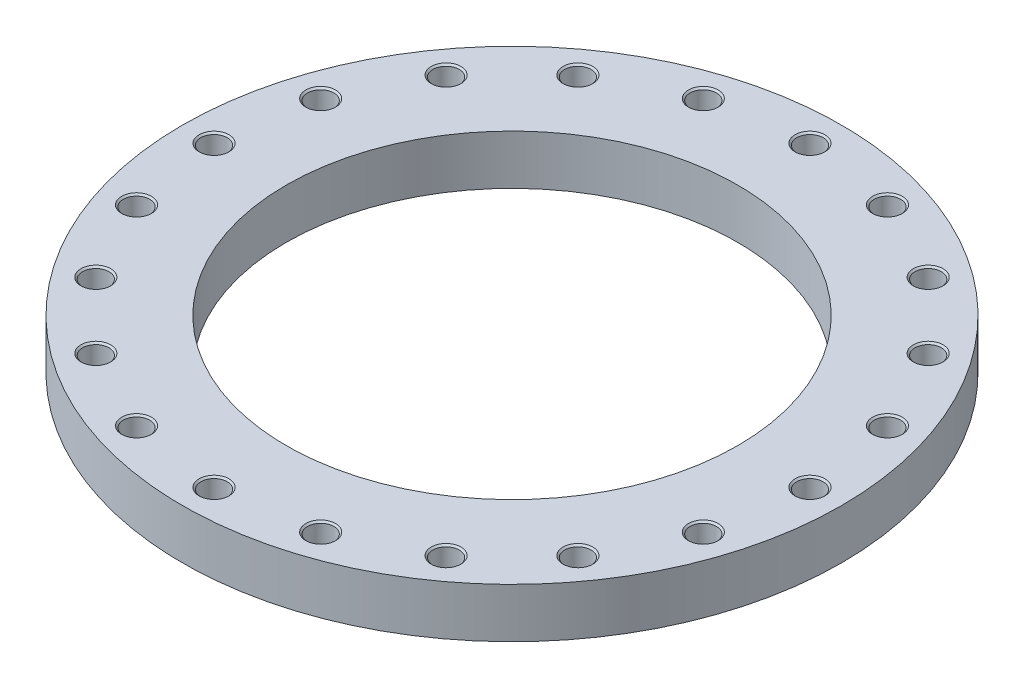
ISO-10303-21;
HEADER;
FILE_DESCRIPTION(('STEP AP214'),'2;1');
FILE_NAME('part.step','',(''),(''),'','','');
FILE_SCHEMA(('AUTOMOTIVE_DESIGN { 1 0 10303 214 1 1 1 1 }'));
ENDSEC;
DATA;
#1=APPLICATION_CONTEXT('core data for automotive mechanical design processes');
#2=APPLICATION_PROTOCOL_DEFINITION('international standard','automotive_design',2000,#1);
#3=PRODUCT_CONTEXT('',#1,'mechanical');
#4=PRODUCT('Part','Part','',(#3));
#5=PRODUCT_RELATED_PRODUCT_CATEGORY('part','',(#4));
#6=PRODUCT_DEFINITION_FORMATION('','',#4);
#7=PRODUCT_DEFINITION_CONTEXT('part definition',#1,'design');
#8=PRODUCT_DEFINITION('design','',#6,#7);
#9=PRODUCT_DEFINITION_SHAPE('','',#8);
#10=(LENGTH_UNIT() NAMED_UNIT(*) SI_UNIT(.MILLI.,.METRE.));
#11=(NAMED_UNIT(*) PLANE_ANGLE_UNIT() SI_UNIT($,.RADIAN.));
#12=(NAMED_UNIT(*) SI_UNIT($,.STERADIAN.) SOLID_ANGLE_UNIT());
#13=UNCERTAINTY_MEASURE_WITH_UNIT(LENGTH_MEASURE(1.E-05),#10,'distance_accuracy_value','');
#14=(GEOMETRIC_REPRESENTATION_CONTEXT(3) GLOBAL_UNCERTAINTY_ASSIGNED_CONTEXT((#13)) GLOBAL_UNIT_ASSIGNED_CONTEXT((#10,
#11,#12)) REPRESENTATION_CONTEXT('',''));
#15=CARTESIAN_POINT('',(0.,0.,0.));
#16=DIRECTION('',(0.,0.,1.));
#17=DIRECTION('',(1.,0.,0.));
#18=AXIS2_PLACEMENT_3D('',#15,#16,#17);
#19=CARTESIAN_POINT('',(0.,27.5,0.));
#20=DIRECTION('',(0.,-1.,0.));
#21=DIRECTION('',(1.,0.,0.));
#22=AXIS2_PLACEMENT_3D('',#19,#20,#21);
#23=CYLINDRICAL_SURFACE('',#22,365.);
#24=CARTESIAN_POINT('',(0.,0.,0.));
#25=DIRECTION('',(0.,1.,0.));
#26=DIRECTION('',(1.,0.,0.));
#27=AXIS2_PLACEMENT_3D('',#24,#25,#26);
#28=CIRCLE('',#27,365.);
#29=CARTESIAN_POINT('',(365.,0.,0.));
#30=VERTEX_POINT('',#29);
#31=EDGE_CURVE('E9',#30,#30,#28,.T.);
#32=ORIENTED_EDGE('',*,*,#31,.T.);
#33=EDGE_LOOP('',(#32));
#34=FACE_BOUND('',#33,.T.);
#35=CARTESIAN_POINT('',(0.,55.,0.));
#36=DIRECTION('',(0.,1.,0.));
#37=DIRECTION('',(1.,0.,0.));
#38=AXIS2_PLACEMENT_3D('',#35,#36,#37);
#39=CIRCLE('',#38,365.);
#40=CARTESIAN_POINT('',(365.,55.,0.));
#41=VERTEX_POINT('',#40);
#42=EDGE_CURVE('E497',#41,#41,#39,.T.);
#43=ORIENTED_EDGE('',*,*,#42,.F.);
#44=EDGE_LOOP('',(#43));
#45=FACE_BOUND('',#44,.T.);
#46=ADVANCED_FACE('F15',(#34,#45),#23,.T.);
#47=CARTESIAN_POINT('',(307.5,0.,0.));
#48=DIRECTION('',(0.,-1.,0.));
#49=DIRECTION('',(-1.,0.,0.));
#50=AXIS2_PLACEMENT_3D('',#47,#48,#49);
#51=PLANE('',#50);
#52=CARTESIAN_POINT('',(0.,0.,0.));
#53=DIRECTION('',(0.,1.,0.));
#54=DIRECTION('',(1.,0.,0.));
#55=AXIS2_PLACEMENT_3D('',#52,#53,#54);
#56=CIRCLE('',#55,250.);
#57=CARTESIAN_POINT('',(250.,0.,0.));
#58=VERTEX_POINT('',#57);
#59=EDGE_CURVE('E22',#58,#58,#56,.T.);
#60=ORIENTED_EDGE('',*,*,#59,.T.);
#61=EDGE_LOOP('',(#60));
#62=FACE_BOUND('',#61,.T.);
#63=ORIENTED_EDGE('',*,*,#31,.F.);
#64=EDGE_LOOP('',(#63));
#65=FACE_BOUND('',#64,.T.);
#66=ADVANCED_FACE('F682',(#62,#65),#51,.T.);
#67=CARTESIAN_POINT('',(0.,27.5,0.));
#68=DIRECTION('',(0.,-1.,0.));
#69=DIRECTION('',(1.,0.,0.));
#70=AXIS2_PLACEMENT_3D('',#67,#68,#69);
#71=CYLINDRICAL_SURFACE('',#70,250.);
#72=CARTESIAN_POINT('',(0.,55.,0.));
#73=DIRECTION('',(0.,1.,0.));
#74=DIRECTION('',(1.,0.,0.));
#75=AXIS2_PLACEMENT_3D('',#72,#73,#74);
#76=CIRCLE('',#75,250.);
#77=CARTESIAN_POINT('',(250.,55.,0.));
#78=VERTEX_POINT('',#77);
#79=EDGE_CURVE('E513',#78,#78,#76,.T.);
#80=ORIENTED_EDGE('',*,*,#79,.T.);
#81=EDGE_LOOP('',(#80));
#82=FACE_BOUND('',#81,.T.);
#83=ORIENTED_EDGE('',*,*,#59,.F.);
#84=EDGE_LOOP('',(#83));
#85=FACE_BOUND('',#84,.T.);
#86=ADVANCED_FACE('F686',(#82,#85),#71,.F.);
#87=CARTESIAN_POINT('',(307.5,55.,0.));
#88=DIRECTION('',(0.,1.,0.));
#89=DIRECTION('',(1.,0.,0.));
#90=AXIS2_PLACEMENT_3D('',#87,#88,#89);
#91=PLANE('',#90);
#92=ORIENTED_EDGE('',*,*,#42,.T.);
#93=EDGE_LOOP('',(#92));
#94=FACE_BOUND('',#93,.T.);
#95=ORIENTED_EDGE('',*,*,#79,.F.);
#96=EDGE_LOOP('',(#95));
#97=FACE_BOUND('',#96,.T.);
#98=CARTESIAN_POINT('',(330.,55.,0.));
#99=DIRECTION('',(0.,-1.,0.));
#100=DIRECTION('',(1.,0.,0.));
#101=AXIS2_PLACEMENT_3D('',#98,#99,#100);
#102=CIRCLE('',#101,16.5);
#103=CARTESIAN_POINT('',(346.5,55.,0.));
#104=VERTEX_POINT('',#103);
#105=EDGE_CURVE('E509',#104,#104,#102,.T.);
#106=ORIENTED_EDGE('',*,*,#105,.T.);
#107=EDGE_LOOP('',(#106));
#108=FACE_BOUND('',#107,.T.);
#109=CARTESIAN_POINT('',(313.848650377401,55.,-101.975608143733));
#110=DIRECTION('',(0.,-1.,0.));
#111=DIRECTION('',(0.951056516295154,0.,-0.309016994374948));
#112=AXIS2_PLACEMENT_3D('',#109,#110,#111);
#113=CIRCLE('',#112,16.5);
#114=CARTESIAN_POINT('',(329.54108289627,55.,-107.074388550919));
#115=VERTEX_POINT('',#114);
#116=EDGE_CURVE('E648',#115,#115,#113,.T.);
#117=ORIENTED_EDGE('',*,*,#116,.T.);
#118=EDGE_LOOP('',(#117));
#119=FACE_BOUND('',#118,.T.);
#120=CARTESIAN_POINT('',(266.975608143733,55.,-193.969133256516));
#121=DIRECTION('',(0.,-1.,0.));
#122=DIRECTION('',(0.809016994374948,0.,-0.587785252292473));
#123=AXIS2_PLACEMENT_3D('',#120,#121,#122);
#124=CIRCLE('',#123,16.5);
#125=CARTESIAN_POINT('',(280.324388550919,55.,-203.667589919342));
#126=VERTEX_POINT('',#125);
#127=EDGE_CURVE('E489',#126,#126,#124,.T.);
#128=ORIENTED_EDGE('',*,*,#127,.T.);
#129=EDGE_LOOP('',(#128));
#130=FACE_BOUND('',#129,.T.);
#131=CARTESIAN_POINT('',(193.969133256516,55.,-266.975608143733));
#132=DIRECTION('',(0.,-1.,0.));
#133=DIRECTION('',(0.587785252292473,0.,-0.809016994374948));
#134=AXIS2_PLACEMENT_3D('',#131,#132,#133);
#135=CIRCLE('',#134,16.5);
#136=CARTESIAN_POINT('',(203.667589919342,55.,-280.324388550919));
#137=VERTEX_POINT('',#136);
#138=EDGE_CURVE('E478',#137,#137,#135,.T.);
#139=ORIENTED_EDGE('',*,*,#138,.T.);
#140=EDGE_LOOP('',(#139));
#141=FACE_BOUND('',#140,.T.);
#142=CARTESIAN_POINT('',(101.975608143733,55.,-313.848650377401));
#143=DIRECTION('',(0.,-1.,0.));
#144=DIRECTION('',(0.309016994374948,0.,-0.951056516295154));
#145=AXIS2_PLACEMENT_3D('',#142,#143,#144);
#146=CIRCLE('',#145,16.5);
#147=CARTESIAN_POINT('',(107.074388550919,55.,-329.54108289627));
#148=VERTEX_POINT('',#147);
#149=EDGE_CURVE('E463',#148,#148,#146,.T.);
#150=ORIENTED_EDGE('',*,*,#149,.T.);
#151=EDGE_LOOP('',(#150));
#152=FACE_BOUND('',#151,.T.);
#153=CARTESIAN_POINT('',(0.,55.,-330.));
#154=DIRECTION('',(0.,-1.,0.));
#155=DIRECTION('',(0.,0.,-1.));
#156=AXIS2_PLACEMENT_3D('',#153,#154,#155);
#157=CIRCLE('',#156,16.5);
#158=CARTESIAN_POINT('',(0.,55.,-346.5));
#159=VERTEX_POINT('',#158);
#160=EDGE_CURVE('E533',#159,#159,#157,.T.);
#161=ORIENTED_EDGE('',*,*,#160,.T.);
#162=EDGE_LOOP('',(#161));
#163=FACE_BOUND('',#162,.T.);
#164=CARTESIAN_POINT('',(-101.975608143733,55.,-313.848650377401));
#165=DIRECTION('',(0.,-1.,0.));
#166=DIRECTION('',(-0.309016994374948,0.,-0.951056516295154));
#167=AXIS2_PLACEMENT_3D('',#164,#165,#166);
#168=CIRCLE('',#167,16.5);
#169=CARTESIAN_POINT('',(-107.074388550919,55.,-329.54108289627));
#170=VERTEX_POINT('',#169);
#171=EDGE_CURVE('E523',#170,#170,#168,.T.);
#172=ORIENTED_EDGE('',*,*,#171,.T.);
#173=EDGE_LOOP('',(#172));
#174=FACE_BOUND('',#173,.T.);
#175=CARTESIAN_POINT('',(-193.969133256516,55.,-266.975608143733));
#176=DIRECTION('',(0.,-1.,0.));
#177=DIRECTION('',(-0.587785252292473,0.,-0.809016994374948));
#178=AXIS2_PLACEMENT_3D('',#175,#176,#177);
#179=CIRCLE('',#178,16.5);
#180=CARTESIAN_POINT('',(-203.667589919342,55.,-280.324388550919));
#181=VERTEX_POINT('',#180);
#182=EDGE_CURVE('E565',#181,#181,#179,.T.);
#183=ORIENTED_EDGE('',*,*,#182,.T.);
#184=EDGE_LOOP('',(#183));
#185=FACE_BOUND('',#184,.T.);
#186=CARTESIAN_POINT('',(-266.975608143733,55.,-193.969133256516));
#187=DIRECTION('',(0.,-1.,0.));
#188=DIRECTION('',(-0.809016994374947,0.,-0.587785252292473));
#189=AXIS2_PLACEMENT_3D('',#186,#187,#188);
#190=CIRCLE('',#189,16.5);
#191=CARTESIAN_POINT('',(-280.324388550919,55.,-203.667589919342));
#192=VERTEX_POINT('',#191);
#193=EDGE_CURVE('E590',#192,#192,#190,.T.);
#194=ORIENTED_EDGE('',*,*,#193,.T.);
#195=EDGE_LOOP('',(#194));
#196=FACE_BOUND('',#195,.T.);
#197=CARTESIAN_POINT('',(-313.848650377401,55.,-101.975608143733));
#198=DIRECTION('',(0.,-1.,0.));
#199=DIRECTION('',(-0.951056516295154,0.,-0.309016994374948));
#200=AXIS2_PLACEMENT_3D('',#197,#198,#199);
#201=CIRCLE('',#200,16.5);
#202=CARTESIAN_POINT('',(-329.54108289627,55.,-107.074388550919));
#203=VERTEX_POINT('',#202);
#204=EDGE_CURVE('E579',#203,#203,#201,.T.);
#205=ORIENTED_EDGE('',*,*,#204,.T.);
#206=EDGE_LOOP('',(#205));
#207=FACE_BOUND('',#206,.T.);
#208=CARTESIAN_POINT('',(-330.,55.,0.));
#209=DIRECTION('',(0.,-1.,0.));
#210=DIRECTION('',(-1.,0.,0.));
#211=AXIS2_PLACEMENT_3D('',#208,#209,#210);
#212=CIRCLE('',#211,16.5);
#213=CARTESIAN_POINT('',(-346.5,55.,0.));
#214=VERTEX_POINT('',#213);
#215=EDGE_CURVE('E561',#214,#214,#212,.T.);
#216=ORIENTED_EDGE('',*,*,#215,.T.);
#217=EDGE_LOOP('',(#216));
#218=FACE_BOUND('',#217,.T.);
#219=CARTESIAN_POINT('',(-313.848650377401,55.,101.975608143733));
#220=DIRECTION('',(0.,-1.,0.));
#221=DIRECTION('',(-0.951056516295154,0.,0.309016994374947));
#222=AXIS2_PLACEMENT_3D('',#219,#220,#221);
#223=CIRCLE('',#222,16.5);
#224=CARTESIAN_POINT('',(-329.54108289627,55.,107.074388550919));
#225=VERTEX_POINT('',#224);
#226=EDGE_CURVE('E546',#225,#225,#223,.T.);
#227=ORIENTED_EDGE('',*,*,#226,.T.);
#228=EDGE_LOOP('',(#227));
#229=FACE_BOUND('',#228,.T.);
#230=CARTESIAN_POINT('',(-266.975608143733,55.,193.969133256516));
#231=DIRECTION('',(0.,-1.,0.));
#232=DIRECTION('',(-0.809016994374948,0.,0.587785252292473));
#233=AXIS2_PLACEMENT_3D('',#230,#231,#232);
#234=CIRCLE('',#233,16.5);
#235=CARTESIAN_POINT('',(-280.324388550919,55.,203.667589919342));
#236=VERTEX_POINT('',#235);
#237=EDGE_CURVE('E652',#236,#236,#234,.T.);
#238=ORIENTED_EDGE('',*,*,#237,.T.);
#239=EDGE_LOOP('',(#238));
#240=FACE_BOUND('',#239,.T.);
#241=CARTESIAN_POINT('',(-193.969133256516,55.,266.975608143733));
#242=DIRECTION('',(0.,-1.,0.));
#243=DIRECTION('',(-0.587785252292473,0.,0.809016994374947));
#244=AXIS2_PLACEMENT_3D('',#241,#242,#243);
#245=CIRCLE('',#244,16.5);
#246=CARTESIAN_POINT('',(-203.667589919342,55.,280.324388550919));
#247=VERTEX_POINT('',#246);
#248=EDGE_CURVE('E641',#247,#247,#245,.T.);
#249=ORIENTED_EDGE('',*,*,#248,.T.);
#250=EDGE_LOOP('',(#249));
#251=FACE_BOUND('',#250,.T.);
#252=CARTESIAN_POINT('',(-101.975608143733,55.,313.848650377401));
#253=DIRECTION('',(0.,-1.,0.));
#254=DIRECTION('',(-0.309016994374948,0.,0.951056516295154));
#255=AXIS2_PLACEMENT_3D('',#252,#253,#254);
#256=CIRCLE('',#255,16.5);
#257=CARTESIAN_POINT('',(-107.074388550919,55.,329.54108289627));
#258=VERTEX_POINT('',#257);
#259=EDGE_CURVE('E626',#258,#258,#256,.T.);
#260=ORIENTED_EDGE('',*,*,#259,.T.);
#261=EDGE_LOOP('',(#260));
#262=FACE_BOUND('',#261,.T.);
#263=CARTESIAN_POINT('',(0.,55.,330.));
#264=DIRECTION('',(0.,-1.,0.));
#265=DIRECTION('',(0.,0.,1.));
#266=AXIS2_PLACEMENT_3D('',#263,#264,#265);
#267=CIRCLE('',#266,16.5);
#268=CARTESIAN_POINT('',(0.,55.,346.5));
#269=VERTEX_POINT('',#268);
#270=EDGE_CURVE('E611',#269,#269,#267,.T.);
#271=ORIENTED_EDGE('',*,*,#270,.T.);
#272=EDGE_LOOP('',(#271));
#273=FACE_BOUND('',#272,.T.);
#274=CARTESIAN_POINT('',(101.975608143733,55.,313.848650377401));
#275=DIRECTION('',(0.,-1.,0.));
#276=DIRECTION('',(0.309016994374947,0.,0.951056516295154));
#277=AXIS2_PLACEMENT_3D('',#274,#275,#276);
#278=CIRCLE('',#277,16.5);
#279=CARTESIAN_POINT('',(107.074388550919,55.,329.54108289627));
#280=VERTEX_POINT('',#279);
#281=EDGE_CURVE('E736',#280,#280,#278,.T.);
#282=ORIENTED_EDGE('',*,*,#281,.T.);
#283=EDGE_LOOP('',(#282));
#284=FACE_BOUND('',#283,.T.);
#285=CARTESIAN_POINT('',(193.969133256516,55.,266.975608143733));
#286=DIRECTION('',(0.,-1.,0.));
#287=DIRECTION('',(0.587785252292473,0.,0.809016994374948));
#288=AXIS2_PLACEMENT_3D('',#285,#286,#287);
#289=CIRCLE('',#288,16.5);
#290=CARTESIAN_POINT('',(203.667589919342,55.,280.324388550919));
#291=VERTEX_POINT('',#290);
#292=EDGE_CURVE('E753',#291,#291,#289,.T.);
#293=ORIENTED_EDGE('',*,*,#292,.T.);
#294=EDGE_LOOP('',(#293));
#295=FACE_BOUND('',#294,.T.);
#296=CARTESIAN_POINT('',(266.975608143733,55.,193.969133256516));
#297=DIRECTION('',(0.,-1.,0.));
#298=DIRECTION('',(0.809016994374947,0.,0.587785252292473));
#299=AXIS2_PLACEMENT_3D('',#296,#297,#298);
#300=CIRCLE('',#299,16.5);
#301=CARTESIAN_POINT('',(280.324388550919,55.,203.667589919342));
#302=VERTEX_POINT('',#301);
#303=EDGE_CURVE('E767',#302,#302,#300,.T.);
#304=ORIENTED_EDGE('',*,*,#303,.T.);
#305=EDGE_LOOP('',(#304));
#306=FACE_BOUND('',#305,.T.);
#307=CARTESIAN_POINT('',(313.848650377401,55.,101.975608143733));
#308=DIRECTION('',(0.,-1.,0.));
#309=DIRECTION('',(0.951056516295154,0.,0.309016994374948));
#310=AXIS2_PLACEMENT_3D('',#307,#308,#309);
#311=CIRCLE('',#310,16.5);
#312=CARTESIAN_POINT('',(329.54108289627,55.,107.074388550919));
#313=VERTEX_POINT('',#312);
#314=EDGE_CURVE('E779',#313,#313,#311,.T.);
#315=ORIENTED_EDGE('',*,*,#314,.T.);
#316=EDGE_LOOP('',(#315));
#317=FACE_BOUND('',#316,.T.);
#318=ADVANCED_FACE('F692',(#94,#97,#108,#119,#130,#141,#152,#163,#174,#185,#196,#207,#218,#229,
#240,#251,#262,#273,#284,#295,#306,#317),#91,.T.);
#319=CARTESIAN_POINT('',(330.,7.78371923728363,0.));
#320=DIRECTION('',(0.,1.,0.));
#321=DIRECTION('',(1.,0.,0.));
#322=AXIS2_PLACEMENT_3D('',#319,#320,#321);
#323=CONICAL_SURFACE('',#322,7.3028125,1.0471975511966);
#324=CARTESIAN_POINT('',(330.,12.,0.));
#325=DIRECTION('',(0.,-1.,0.));
#326=DIRECTION('',(1.,0.,0.));
#327=AXIS2_PLACEMENT_3D('',#324,#325,#326);
#328=CIRCLE('',#327,14.605625);
#329=CARTESIAN_POINT('',(344.605625,12.,0.));
#330=VERTEX_POINT('',#329);
#331=EDGE_CURVE('E516',#330,#330,#328,.T.);
#332=ORIENTED_EDGE('',*,*,#331,.F.);
#333=EDGE_LOOP('',(#332));
#334=FACE_BOUND('',#333,.T.);
#335=CARTESIAN_POINT('',(330.,3.56743847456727,0.));
#336=VERTEX_POINT('',#335);
#337=VERTEX_LOOP('',#336);
#338=FACE_BOUND('',#337,.T.);
#339=ADVANCED_FACE('F944',(#334,#338),#323,.F.);
#340=CARTESIAN_POINT('',(330.,16.5528125,0.));
#341=DIRECTION('',(0.,1.,0.));
#342=DIRECTION('',(1.,0.,0.));
#343=AXIS2_PLACEMENT_3D('',#340,#341,#342);
#344=CYLINDRICAL_SURFACE('',#343,14.605625);
#345=CARTESIAN_POINT('',(330.,21.105625,0.));
#346=DIRECTION('',(0.,-1.,0.));
#347=DIRECTION('',(1.,0.,0.));
#348=AXIS2_PLACEMENT_3D('',#345,#346,#347);
#349=CIRCLE('',#348,14.605625);
#350=CARTESIAN_POINT('',(344.605625,21.105625,0.));
#351=VERTEX_POINT('',#350);
#352=EDGE_CURVE('E511',#351,#351,#349,.T.);
#353=ORIENTED_EDGE('',*,*,#352,.F.);
#354=EDGE_LOOP('',(#353));
#355=FACE_BOUND('',#354,.T.);
#356=ORIENTED_EDGE('',*,*,#331,.T.);
#357=EDGE_LOOP('',(#356));
#358=FACE_BOUND('',#357,.T.);
#359=ADVANCED_FACE('F979',(#355,#358),#344,.F.);
#360=CARTESIAN_POINT('',(330.,22.0528125,0.));
#361=DIRECTION('',(0.,1.,0.));
#362=DIRECTION('',(1.,0.,0.));
#363=AXIS2_PLACEMENT_3D('',#360,#361,#362);
#364=CONICAL_SURFACE('',#363,15.5528125,0.785398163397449);
#365=CARTESIAN_POINT('',(330.,23.,0.));
#366=DIRECTION('',(0.,-1.,0.));
#367=DIRECTION('',(1.,0.,0.));
#368=AXIS2_PLACEMENT_3D('',#365,#366,#367);
#369=CIRCLE('',#368,16.5);
#370=CARTESIAN_POINT('',(346.5,23.,0.));
#371=VERTEX_POINT('',#370);
#372=EDGE_CURVE('E510',#371,#371,#369,.T.);
#373=ORIENTED_EDGE('',*,*,#372,.F.);
#374=EDGE_LOOP('',(#373));
#375=FACE_BOUND('',#374,.T.);
#376=ORIENTED_EDGE('',*,*,#352,.T.);
#377=EDGE_LOOP('',(#376));
#378=FACE_BOUND('',#377,.T.);
#379=ADVANCED_FACE('F982',(#375,#378),#364,.F.);
#380=CARTESIAN_POINT('',(345.5528125,23.,0.));
#381=DIRECTION('',(0.,1.,0.));
#382=DIRECTION('',(-1.,0.,0.));
#383=AXIS2_PLACEMENT_3D('',#380,#381,#382);
#384=PLANE('',#383);
#385=CARTESIAN_POINT('',(330.,23.,0.));
#386=DIRECTION('',(0.,-1.,0.));
#387=DIRECTION('',(1.,0.,0.));
#388=AXIS2_PLACEMENT_3D('',#385,#386,#387);
#389=CIRCLE('',#388,14.605625);
#390=CARTESIAN_POINT('',(344.605625,23.,0.));
#391=VERTEX_POINT('',#390);
#392=EDGE_CURVE('E512',#391,#391,#389,.T.);
#393=ORIENTED_EDGE('',*,*,#392,.F.);
#394=EDGE_LOOP('',(#393));
#395=FACE_BOUND('',#394,.T.);
#396=ORIENTED_EDGE('',*,*,#372,.T.);
#397=EDGE_LOOP('',(#396));
#398=FACE_BOUND('',#397,.T.);
#399=ADVANCED_FACE('F896',(#395,#398),#384,.F.);
#400=CARTESIAN_POINT('',(330.,38.0528125,0.));
#401=DIRECTION('',(0.,1.,0.));
#402=DIRECTION('',(1.,0.,0.));
#403=AXIS2_PLACEMENT_3D('',#400,#401,#402);
#404=CYLINDRICAL_SURFACE('',#403,14.605625);
#405=CARTESIAN_POINT('',(330.,53.105625,0.));
#406=DIRECTION('',(0.,-1.,0.));
#407=DIRECTION('',(1.,0.,0.));
#408=AXIS2_PLACEMENT_3D('',#405,#406,#407);
#409=CIRCLE('',#408,14.605625);
#410=CARTESIAN_POINT('',(344.605625,53.105625,0.));
#411=VERTEX_POINT('',#410);
#412=EDGE_CURVE('E507',#411,#411,#409,.T.);
#413=ORIENTED_EDGE('',*,*,#412,.F.);
#414=EDGE_LOOP('',(#413));
#415=FACE_BOUND('',#414,.T.);
#416=ORIENTED_EDGE('',*,*,#392,.T.);
#417=EDGE_LOOP('',(#416));
#418=FACE_BOUND('',#417,.T.);
#419=ADVANCED_FACE('F893',(#415,#418),#404,.F.);
#420=CARTESIAN_POINT('',(330.,54.0528125,0.));
#421=DIRECTION('',(0.,1.,0.));
#422=DIRECTION('',(1.,0.,0.));
#423=AXIS2_PLACEMENT_3D('',#420,#421,#422);
#424=CONICAL_SURFACE('',#423,15.5528125,0.785398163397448);
#425=ORIENTED_EDGE('',*,*,#105,.F.);
#426=EDGE_LOOP('',(#425));
#427=FACE_BOUND('',#426,.T.);
#428=ORIENTED_EDGE('',*,*,#412,.T.);
#429=EDGE_LOOP('',(#428));
#430=FACE_BOUND('',#429,.T.);
#431=ADVANCED_FACE('F723',(#427,#430),#424,.F.);
#432=CARTESIAN_POINT('',(313.848650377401,7.78371923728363,-101.975608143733));
#433=DIRECTION('',(0.,1.,0.));
#434=DIRECTION('',(0.951056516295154,0.,-0.309016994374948));
#435=AXIS2_PLACEMENT_3D('',#432,#433,#434);
#436=CONICAL_SURFACE('',#435,7.3028125,1.0471975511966);
#437=CARTESIAN_POINT('',(313.848650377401,12.,-101.975608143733));
#438=DIRECTION('',(0.,-1.,0.));
#439=DIRECTION('',(0.951056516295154,0.,-0.309016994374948));
#440=AXIS2_PLACEMENT_3D('',#437,#438,#439);
#441=CIRCLE('',#440,14.605625);
#442=CARTESIAN_POINT('',(327.739425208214,12.,-106.4889944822));
#443=VERTEX_POINT('',#442);
#444=EDGE_CURVE('E506',#443,#443,#441,.T.);
#445=ORIENTED_EDGE('',*,*,#444,.F.);
#446=EDGE_LOOP('',(#445));
#447=FACE_BOUND('',#446,.T.);
#448=CARTESIAN_POINT('',(313.848650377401,3.56743847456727,-101.975608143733));
#449=VERTEX_POINT('',#448);
#450=VERTEX_LOOP('',#449);
#451=FACE_BOUND('',#450,.T.);
#452=ADVANCED_FACE('F715',(#447,#451),#436,.F.);
#453=CARTESIAN_POINT('',(313.848650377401,16.5528125,-101.975608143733));
#454=DIRECTION('',(0.,1.,0.));
#455=DIRECTION('',(0.951056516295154,0.,-0.309016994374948));
#456=AXIS2_PLACEMENT_3D('',#453,#454,#455);
#457=CYLINDRICAL_SURFACE('',#456,14.605625);
#458=CARTESIAN_POINT('',(313.848650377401,21.105625,-101.975608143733));
#459=DIRECTION('',(0.,-1.,0.));
#460=DIRECTION('',(0.951056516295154,0.,-0.309016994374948));
#461=AXIS2_PLACEMENT_3D('',#458,#459,#460);
#462=CIRCLE('',#461,14.605625);
#463=CARTESIAN_POINT('',(327.739425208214,21.105625,-106.4889944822));
#464=VERTEX_POINT('',#463);
#465=EDGE_CURVE('E503',#464,#464,#462,.T.);
#466=ORIENTED_EDGE('',*,*,#465,.F.);
#467=EDGE_LOOP('',(#466));
#468=FACE_BOUND('',#467,.T.);
#469=ORIENTED_EDGE('',*,*,#444,.T.);
#470=EDGE_LOOP('',(#469));
#471=FACE_BOUND('',#470,.T.);
#472=ADVANCED_FACE('F713',(#468,#471),#457,.F.);
#473=CARTESIAN_POINT('',(313.848650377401,22.0528125,-101.975608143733));
#474=DIRECTION('',(0.,1.,0.));
#475=DIRECTION('',(0.951056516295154,0.,-0.309016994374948));
#476=AXIS2_PLACEMENT_3D('',#473,#474,#475);
#477=CONICAL_SURFACE('',#476,15.5528125,0.785398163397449);
#478=CARTESIAN_POINT('',(313.848650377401,23.,-101.975608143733));
#479=DIRECTION('',(0.,-1.,0.));
#480=DIRECTION('',(0.951056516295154,0.,-0.309016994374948));
#481=AXIS2_PLACEMENT_3D('',#478,#479,#480);
#482=CIRCLE('',#481,16.5);
#483=CARTESIAN_POINT('',(329.54108289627,23.,-107.074388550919));
#484=VERTEX_POINT('',#483);
#485=EDGE_CURVE('E501',#484,#484,#482,.T.);
#486=ORIENTED_EDGE('',*,*,#485,.F.);
#487=EDGE_LOOP('',(#486));
#488=FACE_BOUND('',#487,.T.);
#489=ORIENTED_EDGE('',*,*,#465,.T.);
#490=EDGE_LOOP('',(#489));
#491=FACE_BOUND('',#490,.T.);
#492=ADVANCED_FACE('F711',(#488,#491),#477,.F.);
#493=CARTESIAN_POINT('',(328.640254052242,23.,-106.78169151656));
#494=DIRECTION('',(0.,1.,0.));
#495=DIRECTION('',(-0.951056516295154,0.,0.309016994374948));
#496=AXIS2_PLACEMENT_3D('',#493,#494,#495);
#497=PLANE('',#496);
#498=CARTESIAN_POINT('',(313.848650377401,23.,-101.975608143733));
#499=DIRECTION('',(0.,-1.,0.));
#500=DIRECTION('',(0.951056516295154,0.,-0.309016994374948));
#501=AXIS2_PLACEMENT_3D('',#498,#499,#500);
#502=CIRCLE('',#501,14.605625);
#503=CARTESIAN_POINT('',(327.739425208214,23.,-106.4889944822));
#504=VERTEX_POINT('',#503);
#505=EDGE_CURVE('E504',#504,#504,#502,.T.);
#506=ORIENTED_EDGE('',*,*,#505,.F.);
#507=EDGE_LOOP('',(#506));
#508=FACE_BOUND('',#507,.T.);
#509=ORIENTED_EDGE('',*,*,#485,.T.);
#510=EDGE_LOOP('',(#509));
#511=FACE_BOUND('',#510,.T.);
#512=ADVANCED_FACE('F709',(#508,#511),#497,.F.);
#513=CARTESIAN_POINT('',(313.848650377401,38.0528125,-101.975608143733));
#514=DIRECTION('',(0.,1.,0.));
#515=DIRECTION('',(0.951056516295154,0.,-0.309016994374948));
#516=AXIS2_PLACEMENT_3D('',#513,#514,#515);
#517=CYLINDRICAL_SURFACE('',#516,14.605625);
#518=CARTESIAN_POINT('',(313.848650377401,53.105625,-101.975608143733));
#519=DIRECTION('',(0.,-1.,0.));
#520=DIRECTION('',(0.951056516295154,0.,-0.309016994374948));
#521=AXIS2_PLACEMENT_3D('',#518,#519,#520);
#522=CIRCLE('',#521,14.605625);
#523=CARTESIAN_POINT('',(327.739425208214,53.105625,-106.4889944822));
#524=VERTEX_POINT('',#523);
#525=EDGE_CURVE('E500',#524,#524,#522,.T.);
#526=ORIENTED_EDGE('',*,*,#525,.F.);
#527=EDGE_LOOP('',(#526));
#528=FACE_BOUND('',#527,.T.);
#529=ORIENTED_EDGE('',*,*,#505,.T.);
#530=EDGE_LOOP('',(#529));
#531=FACE_BOUND('',#530,.T.);
#532=ADVANCED_FACE('F707',(#528,#531),#517,.F.);
#533=CARTESIAN_POINT('',(313.848650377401,54.0528125,-101.975608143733));
#534=DIRECTION('',(0.,1.,0.));
#535=DIRECTION('',(0.951056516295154,0.,-0.309016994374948));
#536=AXIS2_PLACEMENT_3D('',#533,#534,#535);
#537=CONICAL_SURFACE('',#536,15.5528125,0.785398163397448);
#538=ORIENTED_EDGE('',*,*,#116,.F.);
#539=EDGE_LOOP('',(#538));
#540=FACE_BOUND('',#539,.T.);
#541=ORIENTED_EDGE('',*,*,#525,.T.);
#542=EDGE_LOOP('',(#541));
#543=FACE_BOUND('',#542,.T.);
#544=ADVANCED_FACE('F703',(#540,#543),#537,.F.);
#545=CARTESIAN_POINT('',(266.975608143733,7.78371923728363,-193.969133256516));
#546=DIRECTION('',(0.,1.,0.));
#547=DIRECTION('',(0.809016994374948,0.,-0.587785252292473));
#548=AXIS2_PLACEMENT_3D('',#545,#546,#547);
#549=CONICAL_SURFACE('',#548,7.3028125,1.0471975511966);
#550=CARTESIAN_POINT('',(266.975608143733,12.,-193.969133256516));
#551=DIRECTION('',(0.,-1.,0.));
#552=DIRECTION('',(0.809016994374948,0.,-0.587785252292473));
#553=AXIS2_PLACEMENT_3D('',#550,#551,#552);
#554=CIRCLE('',#553,14.605625);
#555=CARTESIAN_POINT('',(278.7918069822,12.,-202.55410423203));
#556=VERTEX_POINT('',#555);
#557=EDGE_CURVE('E498',#556,#556,#554,.T.);
#558=ORIENTED_EDGE('',*,*,#557,.F.);
#559=EDGE_LOOP('',(#558));
#560=FACE_BOUND('',#559,.T.);
#561=CARTESIAN_POINT('',(266.975608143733,3.56743847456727,-193.969133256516));
#562=VERTEX_POINT('',#561);
#563=VERTEX_LOOP('',#562);
#564=FACE_BOUND('',#563,.T.);
#565=ADVANCED_FACE('F699',(#560,#564),#549,.F.);
#566=CARTESIAN_POINT('',(266.975608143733,16.5528125,-193.969133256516));
#567=DIRECTION('',(0.,1.,0.));
#568=DIRECTION('',(0.809016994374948,0.,-0.587785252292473));
#569=AXIS2_PLACEMENT_3D('',#566,#567,#568);
#570=CYLINDRICAL_SURFACE('',#569,14.605625);
#571=CARTESIAN_POINT('',(266.975608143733,21.105625,-193.969133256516));
#572=DIRECTION('',(0.,-1.,0.));
#573=DIRECTION('',(0.809016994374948,0.,-0.587785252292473));
#574=AXIS2_PLACEMENT_3D('',#571,#572,#573);
#575=CIRCLE('',#574,14.605625);
#576=CARTESIAN_POINT('',(278.7918069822,21.105625,-202.55410423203));
#577=VERTEX_POINT('',#576);
#578=EDGE_CURVE('E495',#577,#577,#575,.T.);
#579=ORIENTED_EDGE('',*,*,#578,.F.);
#580=EDGE_LOOP('',(#579));
#581=FACE_BOUND('',#580,.T.);
#582=ORIENTED_EDGE('',*,*,#557,.T.);
#583=EDGE_LOOP('',(#582));
#584=FACE_BOUND('',#583,.T.);
#585=ADVANCED_FACE('F702',(#581,#584),#570,.F.);
#586=CARTESIAN_POINT('',(266.975608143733,22.0528125,-193.969133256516));
#587=DIRECTION('',(0.,1.,0.));
#588=DIRECTION('',(0.809016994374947,0.,-0.587785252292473));
#589=AXIS2_PLACEMENT_3D('',#586,#587,#588);
#590=CONICAL_SURFACE('',#589,15.5528125,0.785398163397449);
#591=CARTESIAN_POINT('',(266.975608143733,23.,-193.969133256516));
#592=DIRECTION('',(0.,-1.,0.));
#593=DIRECTION('',(0.809016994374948,0.,-0.587785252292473));
#594=AXIS2_PLACEMENT_3D('',#591,#592,#593);
#595=CIRCLE('',#594,16.5);
#596=CARTESIAN_POINT('',(280.324388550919,23.,-203.667589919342));
#597=VERTEX_POINT('',#596);
#598=EDGE_CURVE('E493',#597,#597,#595,.T.);
#599=ORIENTED_EDGE('',*,*,#598,.F.);
#600=EDGE_LOOP('',(#599));
#601=FACE_BOUND('',#600,.T.);
#602=ORIENTED_EDGE('',*,*,#578,.T.);
#603=EDGE_LOOP('',(#602));
#604=FACE_BOUND('',#603,.T.);
#605=ADVANCED_FACE('F1065',(#601,#604),#590,.F.);
#606=CARTESIAN_POINT('',(279.55809776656,23.,-203.110847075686));
#607=DIRECTION('',(0.,1.,0.));
#608=DIRECTION('',(-0.809016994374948,0.,0.587785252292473));
#609=AXIS2_PLACEMENT_3D('',#606,#607,#608);
#610=PLANE('',#609);
#611=CARTESIAN_POINT('',(266.975608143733,23.,-193.969133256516));
#612=DIRECTION('',(0.,-1.,0.));
#613=DIRECTION('',(0.809016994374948,0.,-0.587785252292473));
#614=AXIS2_PLACEMENT_3D('',#611,#612,#613);
#615=CIRCLE('',#614,14.605625);
#616=CARTESIAN_POINT('',(278.7918069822,23.,-202.55410423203));
#617=VERTEX_POINT('',#616);
#618=EDGE_CURVE('E491',#617,#617,#615,.T.);
#619=ORIENTED_EDGE('',*,*,#618,.F.);
#620=EDGE_LOOP('',(#619));
#621=FACE_BOUND('',#620,.T.);
#622=ORIENTED_EDGE('',*,*,#598,.T.);
#623=EDGE_LOOP('',(#622));
#624=FACE_BOUND('',#623,.T.);
#625=ADVANCED_FACE('F697',(#621,#624),#610,.F.);
#626=CARTESIAN_POINT('',(266.975608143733,38.0528125,-193.969133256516));
#627=DIRECTION('',(0.,1.,0.));
#628=DIRECTION('',(0.809016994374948,0.,-0.587785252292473));
#629=AXIS2_PLACEMENT_3D('',#626,#627,#628);
#630=CYLINDRICAL_SURFACE('',#629,14.605625);
#631=CARTESIAN_POINT('',(266.975608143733,53.105625,-193.969133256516));
#632=DIRECTION('',(0.,-1.,0.));
#633=DIRECTION('',(0.809016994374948,0.,-0.587785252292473));
#634=AXIS2_PLACEMENT_3D('',#631,#632,#633);
#635=CIRCLE('',#634,14.605625);
#636=CARTESIAN_POINT('',(278.7918069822,53.105625,-202.55410423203));
#637=VERTEX_POINT('',#636);
#638=EDGE_CURVE('E487',#637,#637,#635,.T.);
#639=ORIENTED_EDGE('',*,*,#638,.F.);
#640=EDGE_LOOP('',(#639));
#641=FACE_BOUND('',#640,.T.);
#642=ORIENTED_EDGE('',*,*,#618,.T.);
#643=EDGE_LOOP('',(#642));
#644=FACE_BOUND('',#643,.T.);
#645=ADVANCED_FACE('F996',(#641,#644),#630,.F.);
#646=CARTESIAN_POINT('',(266.975608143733,54.0528125,-193.969133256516));
#647=DIRECTION('',(0.,1.,0.));
#648=DIRECTION('',(0.809016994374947,0.,-0.587785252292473));
#649=AXIS2_PLACEMENT_3D('',#646,#647,#648);
#650=CONICAL_SURFACE('',#649,15.5528125,0.785398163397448);
#651=ORIENTED_EDGE('',*,*,#127,.F.);
#652=EDGE_LOOP('',(#651));
#653=FACE_BOUND('',#652,.T.);
#654=ORIENTED_EDGE('',*,*,#638,.T.);
#655=EDGE_LOOP('',(#654));
#656=FACE_BOUND('',#655,.T.);
#657=ADVANCED_FACE('F992',(#653,#656),#650,.F.);
#658=CARTESIAN_POINT('',(193.969133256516,7.78371923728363,-266.975608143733));
#659=DIRECTION('',(0.,1.,0.));
#660=DIRECTION('',(0.587785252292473,0.,-0.809016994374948));
#661=AXIS2_PLACEMENT_3D('',#658,#659,#660);
#662=CONICAL_SURFACE('',#661,7.3028125,1.0471975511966);
#663=CARTESIAN_POINT('',(193.969133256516,12.,-266.975608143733));
#664=DIRECTION('',(0.,-1.,0.));
#665=DIRECTION('',(0.587785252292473,0.,-0.809016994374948));
#666=AXIS2_PLACEMENT_3D('',#663,#664,#665);
#667=CIRCLE('',#666,14.605625);
#668=CARTESIAN_POINT('',(202.55410423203,12.,-278.7918069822));
#669=VERTEX_POINT('',#668);
#670=EDGE_CURVE('E485',#669,#669,#667,.T.);
#671=ORIENTED_EDGE('',*,*,#670,.F.);
#672=EDGE_LOOP('',(#671));
#673=FACE_BOUND('',#672,.T.);
#674=CARTESIAN_POINT('',(193.969133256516,3.56743847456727,-266.975608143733));
#675=VERTEX_POINT('',#674);
#676=VERTEX_LOOP('',#675);
#677=FACE_BOUND('',#676,.T.);
#678=ADVANCED_FACE('F995',(#673,#677),#662,.F.);
#679=CARTESIAN_POINT('',(193.969133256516,16.5528125,-266.975608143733));
#680=DIRECTION('',(0.,1.,0.));
#681=DIRECTION('',(0.587785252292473,0.,-0.809016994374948));
#682=AXIS2_PLACEMENT_3D('',#679,#680,#681);
#683=CYLINDRICAL_SURFACE('',#682,14.605625);
#684=CARTESIAN_POINT('',(193.969133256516,21.105625,-266.975608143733));
#685=DIRECTION('',(0.,-1.,0.));
#686=DIRECTION('',(0.587785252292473,0.,-0.809016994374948));
#687=AXIS2_PLACEMENT_3D('',#684,#685,#686);
#688=CIRCLE('',#687,14.605625);
#689=CARTESIAN_POINT('',(202.55410423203,21.105625,-278.7918069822));
#690=VERTEX_POINT('',#689);
#691=EDGE_CURVE('E483',#690,#690,#688,.T.);
#692=ORIENTED_EDGE('',*,*,#691,.F.);
#693=EDGE_LOOP('',(#692));
#694=FACE_BOUND('',#693,.T.);
#695=ORIENTED_EDGE('',*,*,#670,.T.);
#696=EDGE_LOOP('',(#695));
#697=FACE_BOUND('',#696,.T.);
#698=ADVANCED_FACE('F839',(#694,#697),#683,.F.);
#699=CARTESIAN_POINT('',(193.969133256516,22.0528125,-266.975608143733));
#700=DIRECTION('',(0.,1.,0.));
#701=DIRECTION('',(0.587785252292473,0.,-0.809016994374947));
#702=AXIS2_PLACEMENT_3D('',#699,#700,#701);
#703=CONICAL_SURFACE('',#702,15.5528125,0.785398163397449);
#704=CARTESIAN_POINT('',(193.969133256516,23.,-266.975608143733));
#705=DIRECTION('',(0.,-1.,0.));
#706=DIRECTION('',(0.587785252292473,0.,-0.809016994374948));
#707=AXIS2_PLACEMENT_3D('',#704,#705,#706);
#708=CIRCLE('',#707,16.5);
#709=CARTESIAN_POINT('',(203.667589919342,23.,-280.324388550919));
#710=VERTEX_POINT('',#709);
#711=EDGE_CURVE('E482',#710,#710,#708,.T.);
#712=ORIENTED_EDGE('',*,*,#711,.F.);
#713=EDGE_LOOP('',(#712));
#714=FACE_BOUND('',#713,.T.);
#715=ORIENTED_EDGE('',*,*,#691,.T.);
#716=EDGE_LOOP('',(#715));
#717=FACE_BOUND('',#716,.T.);
#718=ADVANCED_FACE('F1023',(#714,#717),#703,.F.);
#719=CARTESIAN_POINT('',(203.110847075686,23.,-279.55809776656));
#720=DIRECTION('',(0.,1.,0.));
#721=DIRECTION('',(-0.587785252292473,0.,0.809016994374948));
#722=AXIS2_PLACEMENT_3D('',#719,#720,#721);
#723=PLANE('',#722);
#724=CARTESIAN_POINT('',(193.969133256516,23.,-266.975608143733));
#725=DIRECTION('',(0.,-1.,0.));
#726=DIRECTION('',(0.587785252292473,0.,-0.809016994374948));
#727=AXIS2_PLACEMENT_3D('',#724,#725,#726);
#728=CIRCLE('',#727,14.605625);
#729=CARTESIAN_POINT('',(202.55410423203,23.,-278.7918069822));
#730=VERTEX_POINT('',#729);
#731=EDGE_CURVE('E480',#730,#730,#728,.T.);
#732=ORIENTED_EDGE('',*,*,#731,.F.);
#733=EDGE_LOOP('',(#732));
#734=FACE_BOUND('',#733,.T.);
#735=ORIENTED_EDGE('',*,*,#711,.T.);
#736=EDGE_LOOP('',(#735));
#737=FACE_BOUND('',#736,.T.);
#738=ADVANCED_FACE('F1025',(#734,#737),#723,.F.);
#739=CARTESIAN_POINT('',(193.969133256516,38.0528125,-266.975608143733));
#740=DIRECTION('',(0.,1.,0.));
#741=DIRECTION('',(0.587785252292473,0.,-0.809016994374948));
#742=AXIS2_PLACEMENT_3D('',#739,#740,#741);
#743=CYLINDRICAL_SURFACE('',#742,14.605625);
#744=CARTESIAN_POINT('',(193.969133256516,53.105625,-266.975608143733));
#745=DIRECTION('',(0.,-1.,0.));
#746=DIRECTION('',(0.587785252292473,0.,-0.809016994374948));
#747=AXIS2_PLACEMENT_3D('',#744,#745,#746);
#748=CIRCLE('',#747,14.605625);
#749=CARTESIAN_POINT('',(202.55410423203,53.105625,-278.7918069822));
#750=VERTEX_POINT('',#749);
#751=EDGE_CURVE('E477',#750,#750,#748,.T.);
#752=ORIENTED_EDGE('',*,*,#751,.F.);
#753=EDGE_LOOP('',(#752));
#754=FACE_BOUND('',#753,.T.);
#755=ORIENTED_EDGE('',*,*,#731,.T.);
#756=EDGE_LOOP('',(#755));
#757=FACE_BOUND('',#756,.T.);
#758=ADVANCED_FACE('F1152',(#754,#757),#743,.F.);
#759=CARTESIAN_POINT('',(193.969133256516,54.0528125,-266.975608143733));
#760=DIRECTION('',(0.,1.,0.));
#761=DIRECTION('',(0.587785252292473,0.,-0.809016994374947));
#762=AXIS2_PLACEMENT_3D('',#759,#760,#761);
#763=CONICAL_SURFACE('',#762,15.5528125,0.785398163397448);
#764=ORIENTED_EDGE('',*,*,#138,.F.);
#765=EDGE_LOOP('',(#764));
#766=FACE_BOUND('',#765,.T.);
#767=ORIENTED_EDGE('',*,*,#751,.T.);
#768=EDGE_LOOP('',(#767));
#769=FACE_BOUND('',#768,.T.);
#770=ADVANCED_FACE('F1087',(#766,#769),#763,.F.);
#771=CARTESIAN_POINT('',(101.975608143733,7.78371923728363,-313.848650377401));
#772=DIRECTION('',(0.,1.,0.));
#773=DIRECTION('',(0.309016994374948,0.,-0.951056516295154));
#774=AXIS2_PLACEMENT_3D('',#771,#772,#773);
#775=CONICAL_SURFACE('',#774,7.3028125,1.0471975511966);
#776=CARTESIAN_POINT('',(101.975608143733,12.,-313.848650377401));
#777=DIRECTION('',(0.,-1.,0.));
#778=DIRECTION('',(0.309016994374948,0.,-0.951056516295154));
#779=AXIS2_PLACEMENT_3D('',#776,#777,#778);
#780=CIRCLE('',#779,14.605625);
#781=CARTESIAN_POINT('',(106.4889944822,12.,-327.739425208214));
#782=VERTEX_POINT('',#781);
#783=EDGE_CURVE('E475',#782,#782,#780,.T.);
#784=ORIENTED_EDGE('',*,*,#783,.F.);
#785=EDGE_LOOP('',(#784));
#786=FACE_BOUND('',#785,.T.);
#787=CARTESIAN_POINT('',(101.975608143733,3.56743847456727,-313.848650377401));
#788=VERTEX_POINT('',#787);
#789=VERTEX_LOOP('',#788);
#790=FACE_BOUND('',#789,.T.);
#791=ADVANCED_FACE('F1084',(#786,#790),#775,.F.);
#792=CARTESIAN_POINT('',(101.975608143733,16.5528125,-313.848650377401));
#793=DIRECTION('',(0.,1.,0.));
#794=DIRECTION('',(0.309016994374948,0.,-0.951056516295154));
#795=AXIS2_PLACEMENT_3D('',#792,#793,#794);
#796=CYLINDRICAL_SURFACE('',#795,14.605625);
#797=CARTESIAN_POINT('',(101.975608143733,21.105625,-313.848650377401));
#798=DIRECTION('',(0.,-1.,0.));
#799=DIRECTION('',(0.309016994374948,0.,-0.951056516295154));
#800=AXIS2_PLACEMENT_3D('',#797,#798,#799);
#801=CIRCLE('',#800,14.605625);
#802=CARTESIAN_POINT('',(106.4889944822,21.105625,-327.739425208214));
#803=VERTEX_POINT('',#802);
#804=EDGE_CURVE('E474',#803,#803,#801,.T.);
#805=ORIENTED_EDGE('',*,*,#804,.F.);
#806=EDGE_LOOP('',(#805));
#807=FACE_BOUND('',#806,.T.);
#808=ORIENTED_EDGE('',*,*,#783,.T.);
#809=EDGE_LOOP('',(#808));
#810=FACE_BOUND('',#809,.T.);
#811=ADVANCED_FACE('F1017',(#807,#810),#796,.F.);
#812=CARTESIAN_POINT('',(101.975608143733,22.0528125,-313.848650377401));
#813=DIRECTION('',(0.,1.,0.));
#814=DIRECTION('',(0.309016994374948,0.,-0.951056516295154));
#815=AXIS2_PLACEMENT_3D('',#812,#813,#814);
#816=CONICAL_SURFACE('',#815,15.5528125,0.785398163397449);
#817=CARTESIAN_POINT('',(101.975608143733,23.,-313.848650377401));
#818=DIRECTION('',(0.,-1.,0.));
#819=DIRECTION('',(0.309016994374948,0.,-0.951056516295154));
#820=AXIS2_PLACEMENT_3D('',#817,#818,#819);
#821=CIRCLE('',#820,16.5);
#822=CARTESIAN_POINT('',(107.074388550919,23.,-329.54108289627));
#823=VERTEX_POINT('',#822);
#824=EDGE_CURVE('E472',#823,#823,#821,.T.);
#825=ORIENTED_EDGE('',*,*,#824,.F.);
#826=EDGE_LOOP('',(#825));
#827=FACE_BOUND('',#826,.T.);
#828=ORIENTED_EDGE('',*,*,#804,.T.);
#829=EDGE_LOOP('',(#828));
#830=FACE_BOUND('',#829,.T.);
#831=ADVANCED_FACE('F1014',(#827,#830),#816,.F.);
#832=CARTESIAN_POINT('',(106.78169151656,23.,-328.640254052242));
#833=DIRECTION('',(0.,1.,0.));
#834=DIRECTION('',(-0.309016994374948,0.,0.951056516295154));
#835=AXIS2_PLACEMENT_3D('',#832,#833,#834);
#836=PLANE('',#835);
#837=CARTESIAN_POINT('',(101.975608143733,23.,-313.848650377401));
#838=DIRECTION('',(0.,-1.,0.));
#839=DIRECTION('',(0.309016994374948,0.,-0.951056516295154));
#840=AXIS2_PLACEMENT_3D('',#837,#838,#839);
#841=CIRCLE('',#840,14.605625);
#842=CARTESIAN_POINT('',(106.4889944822,23.,-327.739425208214));
#843=VERTEX_POINT('',#842);
#844=EDGE_CURVE('E471',#843,#843,#841,.T.);
#845=ORIENTED_EDGE('',*,*,#844,.F.);
#846=EDGE_LOOP('',(#845));
#847=FACE_BOUND('',#846,.T.);
#848=ORIENTED_EDGE('',*,*,#824,.T.);
#849=EDGE_LOOP('',(#848));
#850=FACE_BOUND('',#849,.T.);
#851=ADVANCED_FACE('F845',(#847,#850),#836,.F.);
#852=CARTESIAN_POINT('',(101.975608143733,38.0528125,-313.848650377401));
#853=DIRECTION('',(0.,1.,0.));
#854=DIRECTION('',(0.309016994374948,0.,-0.951056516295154));
#855=AXIS2_PLACEMENT_3D('',#852,#853,#854);
#856=CYLINDRICAL_SURFACE('',#855,14.605625);
#857=CARTESIAN_POINT('',(101.975608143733,53.105625,-313.848650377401));
#858=DIRECTION('',(0.,-1.,0.));
#859=DIRECTION('',(0.309016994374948,0.,-0.951056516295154));
#860=AXIS2_PLACEMENT_3D('',#857,#858,#859);
#861=CIRCLE('',#860,14.605625);
#862=CARTESIAN_POINT('',(106.4889944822,53.105625,-327.739425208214));
#863=VERTEX_POINT('',#862);
#864=EDGE_CURVE('E460',#863,#863,#861,.T.);
#865=ORIENTED_EDGE('',*,*,#864,.F.);
#866=EDGE_LOOP('',(#865));
#867=FACE_BOUND('',#866,.T.);
#868=ORIENTED_EDGE('',*,*,#844,.T.);
#869=EDGE_LOOP('',(#868));
#870=FACE_BOUND('',#869,.T.);
#871=ADVANCED_FACE('F841',(#867,#870),#856,.F.);
#872=CARTESIAN_POINT('',(101.975608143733,54.0528125,-313.848650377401));
#873=DIRECTION('',(0.,1.,0.));
#874=DIRECTION('',(0.309016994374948,0.,-0.951056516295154));
#875=AXIS2_PLACEMENT_3D('',#872,#873,#874);
#876=CONICAL_SURFACE('',#875,15.5528125,0.785398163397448);
#877=ORIENTED_EDGE('',*,*,#149,.F.);
#878=EDGE_LOOP('',(#877));
#879=FACE_BOUND('',#878,.T.);
#880=ORIENTED_EDGE('',*,*,#864,.T.);
#881=EDGE_LOOP('',(#880));
#882=FACE_BOUND('',#881,.T.);
#883=ADVANCED_FACE('F844',(#879,#882),#876,.F.);
#884=CARTESIAN_POINT('',(0.,7.78371923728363,-330.));
#885=DIRECTION('',(0.,1.,0.));
#886=DIRECTION('',(0.,0.,-1.));
#887=AXIS2_PLACEMENT_3D('',#884,#885,#886);
#888=CONICAL_SURFACE('',#887,7.3028125,1.0471975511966);
#889=CARTESIAN_POINT('',(0.,12.,-330.));
#890=DIRECTION('',(0.,-1.,0.));
#891=DIRECTION('',(0.,0.,-1.));
#892=AXIS2_PLACEMENT_3D('',#889,#890,#891);
#893=CIRCLE('',#892,14.605625);
#894=CARTESIAN_POINT('',(0.,12.,-344.605625));
#895=VERTEX_POINT('',#894);
#896=EDGE_CURVE('E457',#895,#895,#893,.T.);
#897=ORIENTED_EDGE('',*,*,#896,.F.);
#898=EDGE_LOOP('',(#897));
#899=FACE_BOUND('',#898,.T.);
#900=CARTESIAN_POINT('',(0.,3.56743847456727,-330.));
#901=VERTEX_POINT('',#900);
#902=VERTEX_LOOP('',#901);
#903=FACE_BOUND('',#902,.T.);
#904=ADVANCED_FACE('F1139',(#899,#903),#888,.F.);
#905=CARTESIAN_POINT('',(0.,16.5528125,-330.));
#906=DIRECTION('',(0.,1.,0.));
#907=DIRECTION('',(0.,0.,-1.));
#908=AXIS2_PLACEMENT_3D('',#905,#906,#907);
#909=CYLINDRICAL_SURFACE('',#908,14.605625);
#910=CARTESIAN_POINT('',(0.,21.105625,-330.));
#911=DIRECTION('',(0.,-1.,0.));
#912=DIRECTION('',(0.,0.,-1.));
#913=AXIS2_PLACEMENT_3D('',#910,#911,#912);
#914=CIRCLE('',#913,14.605625);
#915=CARTESIAN_POINT('',(0.,21.105625,-344.605625));
#916=VERTEX_POINT('',#915);
#917=EDGE_CURVE('E461',#916,#916,#914,.T.);
#918=ORIENTED_EDGE('',*,*,#917,.F.);
#919=EDGE_LOOP('',(#918));
#920=FACE_BOUND('',#919,.T.);
#921=ORIENTED_EDGE('',*,*,#896,.T.);
#922=EDGE_LOOP('',(#921));
#923=FACE_BOUND('',#922,.T.);
#924=ADVANCED_FACE('F458',(#920,#923),#909,.F.);
#925=CARTESIAN_POINT('',(0.,22.0528125,-330.));
#926=DIRECTION('',(0.,1.,0.));
#927=DIRECTION('',(0.,0.,-1.));
#928=AXIS2_PLACEMENT_3D('',#925,#926,#927);
#929=CONICAL_SURFACE('',#928,15.5528125,0.785398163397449);
#930=CARTESIAN_POINT('',(0.,23.,-330.));
#931=DIRECTION('',(0.,-1.,0.));
#932=DIRECTION('',(0.,0.,-1.));
#933=AXIS2_PLACEMENT_3D('',#930,#931,#932);
#934=CIRCLE('',#933,16.5);
#935=CARTESIAN_POINT('',(0.,23.,-346.5));
#936=VERTEX_POINT('',#935);
#937=EDGE_CURVE('E465',#936,#936,#934,.T.);
#938=ORIENTED_EDGE('',*,*,#937,.F.);
#939=EDGE_LOOP('',(#938));
#940=FACE_BOUND('',#939,.T.);
#941=ORIENTED_EDGE('',*,*,#917,.T.);
#942=EDGE_LOOP('',(#941));
#943=FACE_BOUND('',#942,.T.);
#944=ADVANCED_FACE('F1000',(#940,#943),#929,.F.);
#945=CARTESIAN_POINT('',(0.,23.,-345.5528125));
#946=DIRECTION('',(0.,1.,0.));
#947=DIRECTION('',(0.,0.,1.));
#948=AXIS2_PLACEMENT_3D('',#945,#946,#947);
#949=PLANE('',#948);
#950=CARTESIAN_POINT('',(0.,23.,-330.));
#951=DIRECTION('',(0.,-1.,0.));
#952=DIRECTION('',(0.,0.,-1.));
#953=AXIS2_PLACEMENT_3D('',#950,#951,#952);
#954=CIRCLE('',#953,14.605625);
#955=CARTESIAN_POINT('',(0.,23.,-344.605625));
#956=VERTEX_POINT('',#955);
#957=EDGE_CURVE('E534',#956,#956,#954,.T.);
#958=ORIENTED_EDGE('',*,*,#957,.F.);
#959=EDGE_LOOP('',(#958));
#960=FACE_BOUND('',#959,.T.);
#961=ORIENTED_EDGE('',*,*,#937,.T.);
#962=EDGE_LOOP('',(#961));
#963=FACE_BOUND('',#962,.T.);
#964=ADVANCED_FACE('F919',(#960,#963),#949,.F.);
#965=CARTESIAN_POINT('',(0.,38.0528125,-330.));
#966=DIRECTION('',(0.,1.,0.));
#967=DIRECTION('',(0.,0.,-1.));
#968=AXIS2_PLACEMENT_3D('',#965,#966,#967);
#969=CYLINDRICAL_SURFACE('',#968,14.605625);
#970=CARTESIAN_POINT('',(0.,53.105625,-330.));
#971=DIRECTION('',(0.,-1.,0.));
#972=DIRECTION('',(0.,0.,-1.));
#973=AXIS2_PLACEMENT_3D('',#970,#971,#972);
#974=CIRCLE('',#973,14.605625);
#975=CARTESIAN_POINT('',(0.,53.105625,-344.605625));
#976=VERTEX_POINT('',#975);
#977=EDGE_CURVE('E531',#976,#976,#974,.T.);
#978=ORIENTED_EDGE('',*,*,#977,.F.);
#979=EDGE_LOOP('',(#978));
#980=FACE_BOUND('',#979,.T.);
#981=ORIENTED_EDGE('',*,*,#957,.T.);
#982=EDGE_LOOP('',(#981));
#983=FACE_BOUND('',#982,.T.);
#984=ADVANCED_FACE('F916',(#980,#983),#969,.F.);
#985=CARTESIAN_POINT('',(0.,54.0528125,-330.));
#986=DIRECTION('',(0.,1.,0.));
#987=DIRECTION('',(0.,0.,-1.));
#988=AXIS2_PLACEMENT_3D('',#985,#986,#987);
#989=CONICAL_SURFACE('',#988,15.5528125,0.785398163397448);
#990=ORIENTED_EDGE('',*,*,#160,.F.);
#991=EDGE_LOOP('',(#990));
#992=FACE_BOUND('',#991,.T.);
#993=ORIENTED_EDGE('',*,*,#977,.T.);
#994=EDGE_LOOP('',(#993));
#995=FACE_BOUND('',#994,.T.);
#996=ADVANCED_FACE('F890',(#992,#995),#989,.F.);
#997=CARTESIAN_POINT('',(-101.975608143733,7.78371923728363,-313.848650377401));
#998=DIRECTION('',(0.,1.,0.));
#999=DIRECTION('',(-0.309016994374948,0.,-0.951056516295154));
#1000=AXIS2_PLACEMENT_3D('',#997,#998,#999);
#1001=CONICAL_SURFACE('',#1000,7.3028125,1.0471975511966);
#1002=CARTESIAN_POINT('',(-101.975608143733,12.,-313.848650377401));
#1003=DIRECTION('',(0.,-1.,0.));
#1004=DIRECTION('',(-0.309016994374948,0.,-0.951056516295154));
#1005=AXIS2_PLACEMENT_3D('',#1002,#1003,#1004);
#1006=CIRCLE('',#1005,14.605625);
#1007=CARTESIAN_POINT('',(-106.4889944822,12.,-327.739425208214));
#1008=VERTEX_POINT('',#1007);
#1009=EDGE_CURVE('E529',#1008,#1008,#1006,.T.);
#1010=ORIENTED_EDGE('',*,*,#1009,.F.);
#1011=EDGE_LOOP('',(#1010));
#1012=FACE_BOUND('',#1011,.T.);
#1013=CARTESIAN_POINT('',(-101.975608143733,3.56743847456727,-313.848650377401));
#1014=VERTEX_POINT('',#1013);
#1015=VERTEX_LOOP('',#1014);
#1016=FACE_BOUND('',#1015,.T.);
#1017=ADVANCED_FACE('F887',(#1012,#1016),#1001,.F.);
#1018=CARTESIAN_POINT('',(-101.975608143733,16.5528125,-313.848650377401));
#1019=DIRECTION('',(0.,1.,0.));
#1020=DIRECTION('',(-0.309016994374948,0.,-0.951056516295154));
#1021=AXIS2_PLACEMENT_3D('',#1018,#1019,#1020);
#1022=CYLINDRICAL_SURFACE('',#1021,14.605625);
#1023=CARTESIAN_POINT('',(-101.975608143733,21.105625,-313.848650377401));
#1024=DIRECTION('',(0.,-1.,0.));
#1025=DIRECTION('',(-0.309016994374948,0.,-0.951056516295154));
#1026=AXIS2_PLACEMENT_3D('',#1023,#1024,#1025);
#1027=CIRCLE('',#1026,14.605625);
#1028=CARTESIAN_POINT('',(-106.4889944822,21.105625,-327.739425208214));
#1029=VERTEX_POINT('',#1028);
#1030=EDGE_CURVE('E527',#1029,#1029,#1027,.T.);
#1031=ORIENTED_EDGE('',*,*,#1030,.F.);
#1032=EDGE_LOOP('',(#1031));
#1033=FACE_BOUND('',#1032,.T.);
#1034=ORIENTED_EDGE('',*,*,#1009,.T.);
#1035=EDGE_LOOP('',(#1034));
#1036=FACE_BOUND('',#1035,.T.);
#1037=ADVANCED_FACE('F889',(#1033,#1036),#1022,.F.);
#1038=CARTESIAN_POINT('',(-101.975608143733,22.0528125,-313.848650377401));
#1039=DIRECTION('',(0.,1.,0.));
#1040=DIRECTION('',(-0.309016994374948,0.,-0.951056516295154));
#1041=AXIS2_PLACEMENT_3D('',#1038,#1039,#1040);
#1042=CONICAL_SURFACE('',#1041,15.5528125,0.785398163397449);
#1043=CARTESIAN_POINT('',(-101.975608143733,23.,-313.848650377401));
#1044=DIRECTION('',(0.,-1.,0.));
#1045=DIRECTION('',(-0.309016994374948,0.,-0.951056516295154));
#1046=AXIS2_PLACEMENT_3D('',#1043,#1044,#1045);
#1047=CIRCLE('',#1046,16.5);
#1048=CARTESIAN_POINT('',(-107.074388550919,23.,-329.54108289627));
#1049=VERTEX_POINT('',#1048);
#1050=EDGE_CURVE('E525',#1049,#1049,#1047,.T.);
#1051=ORIENTED_EDGE('',*,*,#1050,.F.);
#1052=EDGE_LOOP('',(#1051));
#1053=FACE_BOUND('',#1052,.T.);
#1054=ORIENTED_EDGE('',*,*,#1030,.T.);
#1055=EDGE_LOOP('',(#1054));
#1056=FACE_BOUND('',#1055,.T.);
#1057=ADVANCED_FACE('F1008',(#1053,#1056),#1042,.F.);
#1058=CARTESIAN_POINT('',(-106.78169151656,23.,-328.640254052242));
#1059=DIRECTION('',(0.,1.,0.));
#1060=DIRECTION('',(0.309016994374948,0.,0.951056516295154));
#1061=AXIS2_PLACEMENT_3D('',#1058,#1059,#1060);
#1062=PLANE('',#1061);
#1063=CARTESIAN_POINT('',(-101.975608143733,23.,-313.848650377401));
#1064=DIRECTION('',(0.,-1.,0.));
#1065=DIRECTION('',(-0.309016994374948,0.,-0.951056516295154));
#1066=AXIS2_PLACEMENT_3D('',#1063,#1064,#1065);
#1067=CIRCLE('',#1066,14.605625);
#1068=CARTESIAN_POINT('',(-106.4889944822,23.,-327.739425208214));
#1069=VERTEX_POINT('',#1068);
#1070=EDGE_CURVE('E528',#1069,#1069,#1067,.T.);
#1071=ORIENTED_EDGE('',*,*,#1070,.F.);
#1072=EDGE_LOOP('',(#1071));
#1073=FACE_BOUND('',#1072,.T.);
#1074=ORIENTED_EDGE('',*,*,#1050,.T.);
#1075=EDGE_LOOP('',(#1074));
#1076=FACE_BOUND('',#1075,.T.);
#1077=ADVANCED_FACE('F1129',(#1073,#1076),#1062,.F.);
#1078=CARTESIAN_POINT('',(-101.975608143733,38.0528125,-313.848650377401));
#1079=DIRECTION('',(0.,1.,0.));
#1080=DIRECTION('',(-0.309016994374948,0.,-0.951056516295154));
#1081=AXIS2_PLACEMENT_3D('',#1078,#1079,#1080);
#1082=CYLINDRICAL_SURFACE('',#1081,14.605625);
#1083=CARTESIAN_POINT('',(-101.975608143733,53.105625,-313.848650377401));
#1084=DIRECTION('',(0.,-1.,0.));
#1085=DIRECTION('',(-0.309016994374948,0.,-0.951056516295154));
#1086=AXIS2_PLACEMENT_3D('',#1083,#1084,#1085);
#1087=CIRCLE('',#1086,14.605625);
#1088=CARTESIAN_POINT('',(-106.4889944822,53.105625,-327.739425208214));
#1089=VERTEX_POINT('',#1088);
#1090=EDGE_CURVE('E595',#1089,#1089,#1087,.T.);
#1091=ORIENTED_EDGE('',*,*,#1090,.F.);
#1092=EDGE_LOOP('',(#1091));
#1093=FACE_BOUND('',#1092,.T.);
#1094=ORIENTED_EDGE('',*,*,#1070,.T.);
#1095=EDGE_LOOP('',(#1094));
#1096=FACE_BOUND('',#1095,.T.);
#1097=ADVANCED_FACE('F1125',(#1093,#1096),#1082,.F.);
#1098=CARTESIAN_POINT('',(-101.975608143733,54.0528125,-313.848650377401));
#1099=DIRECTION('',(0.,1.,0.));
#1100=DIRECTION('',(-0.309016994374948,0.,-0.951056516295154));
#1101=AXIS2_PLACEMENT_3D('',#1098,#1099,#1100);
#1102=CONICAL_SURFACE('',#1101,15.5528125,0.785398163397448);
#1103=ORIENTED_EDGE('',*,*,#171,.F.);
#1104=EDGE_LOOP('',(#1103));
#1105=FACE_BOUND('',#1104,.T.);
#1106=ORIENTED_EDGE('',*,*,#1090,.T.);
#1107=EDGE_LOOP('',(#1106));
#1108=FACE_BOUND('',#1107,.T.);
#1109=ADVANCED_FACE('F966',(#1105,#1108),#1102,.F.);
#1110=CARTESIAN_POINT('',(-193.969133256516,7.78371923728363,-266.975608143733));
#1111=DIRECTION('',(0.,1.,0.));
#1112=DIRECTION('',(-0.587785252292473,0.,-0.809016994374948));
#1113=AXIS2_PLACEMENT_3D('',#1110,#1111,#1112);
#1114=CONICAL_SURFACE('',#1113,7.3028125,1.0471975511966);
#1115=CARTESIAN_POINT('',(-193.969133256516,12.,-266.975608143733));
#1116=DIRECTION('',(0.,-1.,0.));
#1117=DIRECTION('',(-0.587785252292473,0.,-0.809016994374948));
#1118=AXIS2_PLACEMENT_3D('',#1115,#1116,#1117);
#1119=CIRCLE('',#1118,14.605625);
#1120=CARTESIAN_POINT('',(-202.55410423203,12.,-278.7918069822));
#1121=VERTEX_POINT('',#1120);
#1122=EDGE_CURVE('E584',#1121,#1121,#1119,.T.);
#1123=ORIENTED_EDGE('',*,*,#1122,.F.);
#1124=EDGE_LOOP('',(#1123));
#1125=FACE_BOUND('',#1124,.T.);
#1126=CARTESIAN_POINT('',(-193.969133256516,3.56743847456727,-266.975608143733));
#1127=VERTEX_POINT('',#1126);
#1128=VERTEX_LOOP('',#1127);
#1129=FACE_BOUND('',#1128,.T.);
#1130=ADVANCED_FACE('F878',(#1125,#1129),#1114,.F.);
#1131=CARTESIAN_POINT('',(-193.969133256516,16.5528125,-266.975608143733));
#1132=DIRECTION('',(0.,1.,0.));
#1133=DIRECTION('',(-0.587785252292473,0.,-0.809016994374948));
#1134=AXIS2_PLACEMENT_3D('',#1131,#1132,#1133);
#1135=CYLINDRICAL_SURFACE('',#1134,14.605625);
#1136=CARTESIAN_POINT('',(-193.969133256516,21.105625,-266.975608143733));
#1137=DIRECTION('',(0.,-1.,0.));
#1138=DIRECTION('',(-0.587785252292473,0.,-0.809016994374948));
#1139=AXIS2_PLACEMENT_3D('',#1136,#1137,#1138);
#1140=CIRCLE('',#1139,14.605625);
#1141=CARTESIAN_POINT('',(-202.55410423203,21.105625,-278.7918069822));
#1142=VERTEX_POINT('',#1141);
#1143=EDGE_CURVE('E582',#1142,#1142,#1140,.T.);
#1144=ORIENTED_EDGE('',*,*,#1143,.F.);
#1145=EDGE_LOOP('',(#1144));
#1146=FACE_BOUND('',#1145,.T.);
#1147=ORIENTED_EDGE('',*,*,#1122,.T.);
#1148=EDGE_LOOP('',(#1147));
#1149=FACE_BOUND('',#1148,.T.);
#1150=ADVANCED_FACE('F867',(#1146,#1149),#1135,.F.);
#1151=CARTESIAN_POINT('',(-193.969133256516,22.0528125,-266.975608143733));
#1152=DIRECTION('',(0.,1.,0.));
#1153=DIRECTION('',(-0.587785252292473,0.,-0.809016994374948));
#1154=AXIS2_PLACEMENT_3D('',#1151,#1152,#1153);
#1155=CONICAL_SURFACE('',#1154,15.5528125,0.785398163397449);
#1156=CARTESIAN_POINT('',(-193.969133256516,23.,-266.975608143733));
#1157=DIRECTION('',(0.,-1.,0.));
#1158=DIRECTION('',(-0.587785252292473,0.,-0.809016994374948));
#1159=AXIS2_PLACEMENT_3D('',#1156,#1157,#1158);
#1160=CIRCLE('',#1159,16.5);
#1161=CARTESIAN_POINT('',(-203.667589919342,23.,-280.324388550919));
#1162=VERTEX_POINT('',#1161);
#1163=EDGE_CURVE('E564',#1162,#1162,#1160,.T.);
#1164=ORIENTED_EDGE('',*,*,#1163,.F.);
#1165=EDGE_LOOP('',(#1164));
#1166=FACE_BOUND('',#1165,.T.);
#1167=ORIENTED_EDGE('',*,*,#1143,.T.);
#1168=EDGE_LOOP('',(#1167));
#1169=FACE_BOUND('',#1168,.T.);
#1170=ADVANCED_FACE('F863',(#1166,#1169),#1155,.F.);
#1171=CARTESIAN_POINT('',(-203.110847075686,23.,-279.55809776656));
#1172=DIRECTION('',(0.,1.,0.));
#1173=DIRECTION('',(0.587785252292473,0.,0.809016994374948));
#1174=AXIS2_PLACEMENT_3D('',#1171,#1172,#1173);
#1175=PLANE('',#1174);
#1176=CARTESIAN_POINT('',(-193.969133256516,23.,-266.975608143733));
#1177=DIRECTION('',(0.,-1.,0.));
#1178=DIRECTION('',(-0.587785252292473,0.,-0.809016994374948));
#1179=AXIS2_PLACEMENT_3D('',#1176,#1177,#1178);
#1180=CIRCLE('',#1179,14.605625);
#1181=CARTESIAN_POINT('',(-202.55410423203,23.,-278.7918069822));
#1182=VERTEX_POINT('',#1181);
#1183=EDGE_CURVE('E562',#1182,#1182,#1180,.T.);
#1184=ORIENTED_EDGE('',*,*,#1183,.F.);
#1185=EDGE_LOOP('',(#1184));
#1186=FACE_BOUND('',#1185,.T.);
#1187=ORIENTED_EDGE('',*,*,#1163,.T.);
#1188=EDGE_LOOP('',(#1187));
#1189=FACE_BOUND('',#1188,.T.);
#1190=ADVANCED_FACE('F866',(#1186,#1189),#1175,.F.);
#1191=CARTESIAN_POINT('',(-193.969133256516,38.0528125,-266.975608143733));
#1192=DIRECTION('',(0.,1.,0.));
#1193=DIRECTION('',(-0.587785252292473,0.,-0.809016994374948));
#1194=AXIS2_PLACEMENT_3D('',#1191,#1192,#1193);
#1195=CYLINDRICAL_SURFACE('',#1194,14.605625);
#1196=CARTESIAN_POINT('',(-193.969133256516,53.105625,-266.975608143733));
#1197=DIRECTION('',(0.,-1.,0.));
#1198=DIRECTION('',(-0.587785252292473,0.,-0.809016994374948));
#1199=AXIS2_PLACEMENT_3D('',#1196,#1197,#1198);
#1200=CIRCLE('',#1199,14.605625);
#1201=CARTESIAN_POINT('',(-202.55410423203,53.105625,-278.7918069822));
#1202=VERTEX_POINT('',#1201);
#1203=EDGE_CURVE('E594',#1202,#1202,#1200,.T.);
#1204=ORIENTED_EDGE('',*,*,#1203,.F.);
#1205=EDGE_LOOP('',(#1204));
#1206=FACE_BOUND('',#1205,.T.);
#1207=ORIENTED_EDGE('',*,*,#1183,.T.);
#1208=EDGE_LOOP('',(#1207));
#1209=FACE_BOUND('',#1208,.T.);
#1210=ADVANCED_FACE('F1288',(#1206,#1209),#1195,.F.);
#1211=CARTESIAN_POINT('',(-193.969133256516,54.0528125,-266.975608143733));
#1212=DIRECTION('',(0.,1.,0.));
#1213=DIRECTION('',(-0.587785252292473,0.,-0.809016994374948));
#1214=AXIS2_PLACEMENT_3D('',#1211,#1212,#1213);
#1215=CONICAL_SURFACE('',#1214,15.5528125,0.785398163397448);
#1216=ORIENTED_EDGE('',*,*,#182,.F.);
#1217=EDGE_LOOP('',(#1216));
#1218=FACE_BOUND('',#1217,.T.);
#1219=ORIENTED_EDGE('',*,*,#1203,.T.);
#1220=EDGE_LOOP('',(#1219));
#1221=FACE_BOUND('',#1220,.T.);
#1222=ADVANCED_FACE('F1295',(#1218,#1221),#1215,.F.);
#1223=CARTESIAN_POINT('',(-266.975608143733,7.78371923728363,-193.969133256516));
#1224=DIRECTION('',(0.,1.,0.));
#1225=DIRECTION('',(-0.809016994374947,0.,-0.587785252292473));
#1226=AXIS2_PLACEMENT_3D('',#1223,#1224,#1225);
#1227=CONICAL_SURFACE('',#1226,7.3028125,1.0471975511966);
#1228=CARTESIAN_POINT('',(-266.975608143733,12.,-193.969133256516));
#1229=DIRECTION('',(0.,-1.,0.));
#1230=DIRECTION('',(-0.809016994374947,0.,-0.587785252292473));
#1231=AXIS2_PLACEMENT_3D('',#1228,#1229,#1230);
#1232=CIRCLE('',#1231,14.605625);
#1233=CARTESIAN_POINT('',(-278.7918069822,12.,-202.55410423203));
#1234=VERTEX_POINT('',#1233);
#1235=EDGE_CURVE('E554',#1234,#1234,#1232,.T.);
#1236=ORIENTED_EDGE('',*,*,#1235,.F.);
#1237=EDGE_LOOP('',(#1236));
#1238=FACE_BOUND('',#1237,.T.);
#1239=CARTESIAN_POINT('',(-266.975608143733,3.56743847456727,-193.969133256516));
#1240=VERTEX_POINT('',#1239);
#1241=VERTEX_LOOP('',#1240);
#1242=FACE_BOUND('',#1241,.T.);
#1243=ADVANCED_FACE('F1302',(#1238,#1242),#1227,.F.);
#1244=CARTESIAN_POINT('',(-266.975608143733,16.5528125,-193.969133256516));
#1245=DIRECTION('',(0.,1.,0.));
#1246=DIRECTION('',(-0.809016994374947,0.,-0.587785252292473));
#1247=AXIS2_PLACEMENT_3D('',#1244,#1245,#1246);
#1248=CYLINDRICAL_SURFACE('',#1247,14.605625);
#1249=CARTESIAN_POINT('',(-266.975608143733,21.105625,-193.969133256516));
#1250=DIRECTION('',(0.,-1.,0.));
#1251=DIRECTION('',(-0.809016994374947,0.,-0.587785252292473));
#1252=AXIS2_PLACEMENT_3D('',#1249,#1250,#1251);
#1253=CIRCLE('',#1252,14.605625);
#1254=CARTESIAN_POINT('',(-278.7918069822,21.105625,-202.55410423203));
#1255=VERTEX_POINT('',#1254);
#1256=EDGE_CURVE('E552',#1255,#1255,#1253,.T.);
#1257=ORIENTED_EDGE('',*,*,#1256,.F.);
#1258=EDGE_LOOP('',(#1257));
#1259=FACE_BOUND('',#1258,.T.);
#1260=ORIENTED_EDGE('',*,*,#1235,.T.);
#1261=EDGE_LOOP('',(#1260));
#1262=FACE_BOUND('',#1261,.T.);
#1263=ADVANCED_FACE('F1310',(#1259,#1262),#1248,.F.);
#1264=CARTESIAN_POINT('',(-266.975608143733,22.0528125,-193.969133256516));
#1265=DIRECTION('',(0.,1.,0.));
#1266=DIRECTION('',(-0.809016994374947,0.,-0.587785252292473));
#1267=AXIS2_PLACEMENT_3D('',#1264,#1265,#1266);
#1268=CONICAL_SURFACE('',#1267,15.5528125,0.785398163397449);
#1269=CARTESIAN_POINT('',(-266.975608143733,23.,-193.969133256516));
#1270=DIRECTION('',(0.,-1.,0.));
#1271=DIRECTION('',(-0.809016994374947,0.,-0.587785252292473));
#1272=AXIS2_PLACEMENT_3D('',#1269,#1270,#1271);
#1273=CIRCLE('',#1272,16.5);
#1274=CARTESIAN_POINT('',(-280.324388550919,23.,-203.667589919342));
#1275=VERTEX_POINT('',#1274);
#1276=EDGE_CURVE('E555',#1275,#1275,#1273,.T.);
#1277=ORIENTED_EDGE('',*,*,#1276,.F.);
#1278=EDGE_LOOP('',(#1277));
#1279=FACE_BOUND('',#1278,.T.);
#1280=ORIENTED_EDGE('',*,*,#1256,.T.);
#1281=EDGE_LOOP('',(#1280));
#1282=FACE_BOUND('',#1281,.T.);
#1283=ADVANCED_FACE('F902',(#1279,#1282),#1268,.F.);
#1284=CARTESIAN_POINT('',(-279.55809776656,23.,-203.110847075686));
#1285=DIRECTION('',(0.,1.,0.));
#1286=DIRECTION('',(0.809016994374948,0.,0.587785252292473));
#1287=AXIS2_PLACEMENT_3D('',#1284,#1285,#1286);
#1288=PLANE('',#1287);
#1289=CARTESIAN_POINT('',(-266.975608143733,23.,-193.969133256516));
#1290=DIRECTION('',(0.,-1.,0.));
#1291=DIRECTION('',(-0.809016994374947,0.,-0.587785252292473));
#1292=AXIS2_PLACEMENT_3D('',#1289,#1290,#1291);
#1293=CIRCLE('',#1292,14.605625);
#1294=CARTESIAN_POINT('',(-278.7918069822,23.,-202.55410423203));
#1295=VERTEX_POINT('',#1294);
#1296=EDGE_CURVE('E591',#1295,#1295,#1293,.T.);
#1297=ORIENTED_EDGE('',*,*,#1296,.F.);
#1298=EDGE_LOOP('',(#1297));
#1299=FACE_BOUND('',#1298,.T.);
#1300=ORIENTED_EDGE('',*,*,#1276,.T.);
#1301=EDGE_LOOP('',(#1300));
#1302=FACE_BOUND('',#1301,.T.);
#1303=ADVANCED_FACE('F898',(#1299,#1302),#1288,.F.);
#1304=CARTESIAN_POINT('',(-266.975608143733,38.0528125,-193.969133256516));
#1305=DIRECTION('',(0.,1.,0.));
#1306=DIRECTION('',(-0.809016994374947,0.,-0.587785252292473));
#1307=AXIS2_PLACEMENT_3D('',#1304,#1305,#1306);
#1308=CYLINDRICAL_SURFACE('',#1307,14.605625);
#1309=CARTESIAN_POINT('',(-266.975608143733,53.105625,-193.969133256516));
#1310=DIRECTION('',(0.,-1.,0.));
#1311=DIRECTION('',(-0.809016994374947,0.,-0.587785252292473));
#1312=AXIS2_PLACEMENT_3D('',#1309,#1310,#1311);
#1313=CIRCLE('',#1312,14.605625);
#1314=CARTESIAN_POINT('',(-278.7918069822,53.105625,-202.55410423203));
#1315=VERTEX_POINT('',#1314);
#1316=EDGE_CURVE('E587',#1315,#1315,#1313,.T.);
#1317=ORIENTED_EDGE('',*,*,#1316,.F.);
#1318=EDGE_LOOP('',(#1317));
#1319=FACE_BOUND('',#1318,.T.);
#1320=ORIENTED_EDGE('',*,*,#1296,.T.);
#1321=EDGE_LOOP('',(#1320));
#1322=FACE_BOUND('',#1321,.T.);
#1323=ADVANCED_FACE('F901',(#1319,#1322),#1308,.F.);
#1324=CARTESIAN_POINT('',(-266.975608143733,54.0528125,-193.969133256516));
#1325=DIRECTION('',(0.,1.,0.));
#1326=DIRECTION('',(-0.809016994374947,0.,-0.587785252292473));
#1327=AXIS2_PLACEMENT_3D('',#1324,#1325,#1326);
#1328=CONICAL_SURFACE('',#1327,15.5528125,0.785398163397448);
#1329=ORIENTED_EDGE('',*,*,#193,.F.);
#1330=EDGE_LOOP('',(#1329));
#1331=FACE_BOUND('',#1330,.T.);
#1332=ORIENTED_EDGE('',*,*,#1316,.T.);
#1333=EDGE_LOOP('',(#1332));
#1334=FACE_BOUND('',#1333,.T.);
#1335=ADVANCED_FACE('F927',(#1331,#1334),#1328,.F.);
#1336=CARTESIAN_POINT('',(-313.848650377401,7.78371923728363,-101.975608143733));
#1337=DIRECTION('',(0.,1.,0.));
#1338=DIRECTION('',(-0.951056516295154,0.,-0.309016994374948));
#1339=AXIS2_PLACEMENT_3D('',#1336,#1337,#1338);
#1340=CONICAL_SURFACE('',#1339,7.3028125,1.0471975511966);
#1341=CARTESIAN_POINT('',(-313.848650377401,12.,-101.975608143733));
#1342=DIRECTION('',(0.,-1.,0.));
#1343=DIRECTION('',(-0.951056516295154,0.,-0.309016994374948));
#1344=AXIS2_PLACEMENT_3D('',#1341,#1342,#1343);
#1345=CIRCLE('',#1344,14.605625);
#1346=CARTESIAN_POINT('',(-327.739425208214,12.,-106.4889944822));
#1347=VERTEX_POINT('',#1346);
#1348=EDGE_CURVE('E585',#1347,#1347,#1345,.T.);
#1349=ORIENTED_EDGE('',*,*,#1348,.F.);
#1350=EDGE_LOOP('',(#1349));
#1351=FACE_BOUND('',#1350,.T.);
#1352=CARTESIAN_POINT('',(-313.848650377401,3.56743847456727,-101.975608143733));
#1353=VERTEX_POINT('',#1352);
#1354=VERTEX_LOOP('',#1353);
#1355=FACE_BOUND('',#1354,.T.);
#1356=ADVANCED_FACE('F884',(#1351,#1355),#1340,.F.);
#1357=CARTESIAN_POINT('',(-313.848650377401,16.5528125,-101.975608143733));
#1358=DIRECTION('',(0.,1.,0.));
#1359=DIRECTION('',(-0.951056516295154,0.,-0.309016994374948));
#1360=AXIS2_PLACEMENT_3D('',#1357,#1358,#1359);
#1361=CYLINDRICAL_SURFACE('',#1360,14.605625);
#1362=CARTESIAN_POINT('',(-313.848650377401,21.105625,-101.975608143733));
#1363=DIRECTION('',(0.,-1.,0.));
#1364=DIRECTION('',(-0.951056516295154,0.,-0.309016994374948));
#1365=AXIS2_PLACEMENT_3D('',#1362,#1363,#1364);
#1366=CIRCLE('',#1365,14.605625);
#1367=CARTESIAN_POINT('',(-327.739425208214,21.105625,-106.4889944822));
#1368=VERTEX_POINT('',#1367);
#1369=EDGE_CURVE('E588',#1368,#1368,#1366,.T.);
#1370=ORIENTED_EDGE('',*,*,#1369,.F.);
#1371=EDGE_LOOP('',(#1370));
#1372=FACE_BOUND('',#1371,.T.);
#1373=ORIENTED_EDGE('',*,*,#1348,.T.);
#1374=EDGE_LOOP('',(#1373));
#1375=FACE_BOUND('',#1374,.T.);
#1376=ADVANCED_FACE('F881',(#1372,#1375),#1361,.F.);
#1377=CARTESIAN_POINT('',(-313.848650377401,22.0528125,-101.975608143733));
#1378=DIRECTION('',(0.,1.,0.));
#1379=DIRECTION('',(-0.951056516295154,0.,-0.309016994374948));
#1380=AXIS2_PLACEMENT_3D('',#1377,#1378,#1379);
#1381=CONICAL_SURFACE('',#1380,15.5528125,0.785398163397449);
#1382=CARTESIAN_POINT('',(-313.848650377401,23.,-101.975608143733));
#1383=DIRECTION('',(0.,-1.,0.));
#1384=DIRECTION('',(-0.951056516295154,0.,-0.309016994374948));
#1385=AXIS2_PLACEMENT_3D('',#1382,#1383,#1384);
#1386=CIRCLE('',#1385,16.5);
#1387=CARTESIAN_POINT('',(-329.54108289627,23.,-107.074388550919));
#1388=VERTEX_POINT('',#1387);
#1389=EDGE_CURVE('E619',#1388,#1388,#1386,.T.);
#1390=ORIENTED_EDGE('',*,*,#1389,.F.);
#1391=EDGE_LOOP('',(#1390));
#1392=FACE_BOUND('',#1391,.T.);
#1393=ORIENTED_EDGE('',*,*,#1369,.T.);
#1394=EDGE_LOOP('',(#1393));
#1395=FACE_BOUND('',#1394,.T.);
#1396=ADVANCED_FACE('F883',(#1392,#1395),#1381,.F.);
#1397=CARTESIAN_POINT('',(-328.640254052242,23.,-106.78169151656));
#1398=DIRECTION('',(0.,1.,0.));
#1399=DIRECTION('',(0.951056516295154,0.,0.309016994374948));
#1400=AXIS2_PLACEMENT_3D('',#1397,#1398,#1399);
#1401=PLANE('',#1400);
#1402=CARTESIAN_POINT('',(-313.848650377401,23.,-101.975608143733));
#1403=DIRECTION('',(0.,-1.,0.));
#1404=DIRECTION('',(-0.951056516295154,0.,-0.309016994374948));
#1405=AXIS2_PLACEMENT_3D('',#1402,#1403,#1404);
#1406=CIRCLE('',#1405,14.605625);
#1407=CARTESIAN_POINT('',(-327.739425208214,23.,-106.4889944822));
#1408=VERTEX_POINT('',#1407);
#1409=EDGE_CURVE('E581',#1408,#1408,#1406,.T.);
#1410=ORIENTED_EDGE('',*,*,#1409,.F.);
#1411=EDGE_LOOP('',(#1410));
#1412=FACE_BOUND('',#1411,.T.);
#1413=ORIENTED_EDGE('',*,*,#1389,.T.);
#1414=EDGE_LOOP('',(#1413));
#1415=FACE_BOUND('',#1414,.T.);
#1416=ADVANCED_FACE('F1358',(#1412,#1415),#1401,.F.);
#1417=CARTESIAN_POINT('',(-313.848650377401,38.0528125,-101.975608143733));
#1418=DIRECTION('',(0.,1.,0.));
#1419=DIRECTION('',(-0.951056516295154,0.,-0.309016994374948));
#1420=AXIS2_PLACEMENT_3D('',#1417,#1418,#1419);
#1421=CYLINDRICAL_SURFACE('',#1420,14.605625);
#1422=CARTESIAN_POINT('',(-313.848650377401,53.105625,-101.975608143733));
#1423=DIRECTION('',(0.,-1.,0.));
#1424=DIRECTION('',(-0.951056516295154,0.,-0.309016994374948));
#1425=AXIS2_PLACEMENT_3D('',#1422,#1423,#1424);
#1426=CIRCLE('',#1425,14.605625);
#1427=CARTESIAN_POINT('',(-327.739425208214,53.105625,-106.4889944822));
#1428=VERTEX_POINT('',#1427);
#1429=EDGE_CURVE('E577',#1428,#1428,#1426,.T.);
#1430=ORIENTED_EDGE('',*,*,#1429,.F.);
#1431=EDGE_LOOP('',(#1430));
#1432=FACE_BOUND('',#1431,.T.);
#1433=ORIENTED_EDGE('',*,*,#1409,.T.);
#1434=EDGE_LOOP('',(#1433));
#1435=FACE_BOUND('',#1434,.T.);
#1436=ADVANCED_FACE('F1366',(#1432,#1435),#1421,.F.);
#1437=CARTESIAN_POINT('',(-313.848650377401,54.0528125,-101.975608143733));
#1438=DIRECTION('',(0.,1.,0.));
#1439=DIRECTION('',(-0.951056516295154,0.,-0.309016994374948));
#1440=AXIS2_PLACEMENT_3D('',#1437,#1438,#1439);
#1441=CONICAL_SURFACE('',#1440,15.5528125,0.785398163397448);
#1442=ORIENTED_EDGE('',*,*,#204,.F.);
#1443=EDGE_LOOP('',(#1442));
#1444=FACE_BOUND('',#1443,.T.);
#1445=ORIENTED_EDGE('',*,*,#1429,.T.);
#1446=EDGE_LOOP('',(#1445));
#1447=FACE_BOUND('',#1446,.T.);
#1448=ADVANCED_FACE('F857',(#1444,#1447),#1441,.F.);
#1449=CARTESIAN_POINT('',(-330.,7.78371923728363,0.));
#1450=DIRECTION('',(0.,1.,0.));
#1451=DIRECTION('',(-1.,0.,0.));
#1452=AXIS2_PLACEMENT_3D('',#1449,#1450,#1451);
#1453=CONICAL_SURFACE('',#1452,7.3028125,1.0471975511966);
#1454=CARTESIAN_POINT('',(-330.,12.,0.));
#1455=DIRECTION('',(0.,-1.,0.));
#1456=DIRECTION('',(-1.,0.,0.));
#1457=AXIS2_PLACEMENT_3D('',#1454,#1455,#1456);
#1458=CIRCLE('',#1457,14.605625);
#1459=CARTESIAN_POINT('',(-344.605625,12.,0.));
#1460=VERTEX_POINT('',#1459);
#1461=EDGE_CURVE('E575',#1460,#1460,#1458,.T.);
#1462=ORIENTED_EDGE('',*,*,#1461,.F.);
#1463=EDGE_LOOP('',(#1462));
#1464=FACE_BOUND('',#1463,.T.);
#1465=CARTESIAN_POINT('',(-330.,3.56743847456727,0.));
#1466=VERTEX_POINT('',#1465);
#1467=VERTEX_LOOP('',#1466);
#1468=FACE_BOUND('',#1467,.T.);
#1469=ADVANCED_FACE('F853',(#1464,#1468),#1453,.F.);
#1470=CARTESIAN_POINT('',(-330.,16.5528125,0.));
#1471=DIRECTION('',(0.,1.,0.));
#1472=DIRECTION('',(-1.,0.,0.));
#1473=AXIS2_PLACEMENT_3D('',#1470,#1471,#1472);
#1474=CYLINDRICAL_SURFACE('',#1473,14.605625);
#1475=CARTESIAN_POINT('',(-330.,21.105625,0.));
#1476=DIRECTION('',(0.,-1.,0.));
#1477=DIRECTION('',(-1.,0.,0.));
#1478=AXIS2_PLACEMENT_3D('',#1475,#1476,#1477);
#1479=CIRCLE('',#1478,14.605625);
#1480=CARTESIAN_POINT('',(-344.605625,21.105625,0.));
#1481=VERTEX_POINT('',#1480);
#1482=EDGE_CURVE('E572',#1481,#1481,#1479,.T.);
#1483=ORIENTED_EDGE('',*,*,#1482,.F.);
#1484=EDGE_LOOP('',(#1483));
#1485=FACE_BOUND('',#1484,.T.);
#1486=ORIENTED_EDGE('',*,*,#1461,.T.);
#1487=EDGE_LOOP('',(#1486));
#1488=FACE_BOUND('',#1487,.T.);
#1489=ADVANCED_FACE('F856',(#1485,#1488),#1474,.F.);
#1490=CARTESIAN_POINT('',(-330.,22.0528125,0.));
#1491=DIRECTION('',(0.,1.,0.));
#1492=DIRECTION('',(-1.,0.,0.));
#1493=AXIS2_PLACEMENT_3D('',#1490,#1491,#1492);
#1494=CONICAL_SURFACE('',#1493,15.5528125,0.785398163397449);
#1495=CARTESIAN_POINT('',(-330.,23.,0.));
#1496=DIRECTION('',(0.,-1.,0.));
#1497=DIRECTION('',(-1.,0.,0.));
#1498=AXIS2_PLACEMENT_3D('',#1495,#1496,#1497);
#1499=CIRCLE('',#1498,16.5);
#1500=CARTESIAN_POINT('',(-346.5,23.,0.));
#1501=VERTEX_POINT('',#1500);
#1502=EDGE_CURVE('E570',#1501,#1501,#1499,.T.);
#1503=ORIENTED_EDGE('',*,*,#1502,.F.);
#1504=EDGE_LOOP('',(#1503));
#1505=FACE_BOUND('',#1504,.T.);
#1506=ORIENTED_EDGE('',*,*,#1482,.T.);
#1507=EDGE_LOOP('',(#1506));
#1508=FACE_BOUND('',#1507,.T.);
#1509=ADVANCED_FACE('F869',(#1505,#1508),#1494,.F.);
#1510=CARTESIAN_POINT('',(-345.5528125,23.,0.));
#1511=DIRECTION('',(0.,1.,0.));
#1512=DIRECTION('',(1.,0.,0.));
#1513=AXIS2_PLACEMENT_3D('',#1510,#1511,#1512);
#1514=PLANE('',#1513);
#1515=CARTESIAN_POINT('',(-330.,23.,0.));
#1516=DIRECTION('',(0.,-1.,0.));
#1517=DIRECTION('',(-1.,0.,0.));
#1518=AXIS2_PLACEMENT_3D('',#1515,#1516,#1517);
#1519=CIRCLE('',#1518,14.605625);
#1520=CARTESIAN_POINT('',(-344.605625,23.,0.));
#1521=VERTEX_POINT('',#1520);
#1522=EDGE_CURVE('E567',#1521,#1521,#1519,.T.);
#1523=ORIENTED_EDGE('',*,*,#1522,.F.);
#1524=EDGE_LOOP('',(#1523));
#1525=FACE_BOUND('',#1524,.T.);
#1526=ORIENTED_EDGE('',*,*,#1502,.T.);
#1527=EDGE_LOOP('',(#1526));
#1528=FACE_BOUND('',#1527,.T.);
#1529=ADVANCED_FACE('F872',(#1525,#1528),#1514,.F.);
#1530=CARTESIAN_POINT('',(-330.,38.0528125,0.));
#1531=DIRECTION('',(0.,1.,0.));
#1532=DIRECTION('',(-1.,0.,0.));
#1533=AXIS2_PLACEMENT_3D('',#1530,#1531,#1532);
#1534=CYLINDRICAL_SURFACE('',#1533,14.605625);
#1535=CARTESIAN_POINT('',(-330.,53.105625,0.));
#1536=DIRECTION('',(0.,-1.,0.));
#1537=DIRECTION('',(-1.,0.,0.));
#1538=AXIS2_PLACEMENT_3D('',#1535,#1536,#1537);
#1539=CIRCLE('',#1538,14.605625);
#1540=CARTESIAN_POINT('',(-344.605625,53.105625,0.));
#1541=VERTEX_POINT('',#1540);
#1542=EDGE_CURVE('E559',#1541,#1541,#1539,.T.);
#1543=ORIENTED_EDGE('',*,*,#1542,.F.);
#1544=EDGE_LOOP('',(#1543));
#1545=FACE_BOUND('',#1544,.T.);
#1546=ORIENTED_EDGE('',*,*,#1522,.T.);
#1547=EDGE_LOOP('',(#1546));
#1548=FACE_BOUND('',#1547,.T.);
#1549=ADVANCED_FACE('F933',(#1545,#1548),#1534,.F.);
#1550=CARTESIAN_POINT('',(-330.,54.0528125,0.));
#1551=DIRECTION('',(0.,1.,0.));
#1552=DIRECTION('',(-1.,0.,0.));
#1553=AXIS2_PLACEMENT_3D('',#1550,#1551,#1552);
#1554=CONICAL_SURFACE('',#1553,15.5528125,0.785398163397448);
#1555=ORIENTED_EDGE('',*,*,#215,.F.);
#1556=EDGE_LOOP('',(#1555));
#1557=FACE_BOUND('',#1556,.T.);
#1558=ORIENTED_EDGE('',*,*,#1542,.T.);
#1559=EDGE_LOOP('',(#1558));
#1560=FACE_BOUND('',#1559,.T.);
#1561=ADVANCED_FACE('F936',(#1557,#1560),#1554,.F.);
#1562=CARTESIAN_POINT('',(-313.848650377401,7.78371923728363,101.975608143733));
#1563=DIRECTION('',(0.,1.,0.));
#1564=DIRECTION('',(-0.951056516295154,0.,0.309016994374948));
#1565=AXIS2_PLACEMENT_3D('',#1562,#1563,#1564);
#1566=CONICAL_SURFACE('',#1565,7.3028125,1.0471975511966);
#1567=CARTESIAN_POINT('',(-313.848650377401,12.,101.975608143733));
#1568=DIRECTION('',(0.,-1.,0.));
#1569=DIRECTION('',(-0.951056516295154,0.,0.309016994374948));
#1570=AXIS2_PLACEMENT_3D('',#1567,#1568,#1569);
#1571=CIRCLE('',#1570,14.605625);
#1572=CARTESIAN_POINT('',(-327.739425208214,12.,106.4889944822));
#1573=VERTEX_POINT('',#1572);
#1574=EDGE_CURVE('E557',#1573,#1573,#1571,.T.);
#1575=ORIENTED_EDGE('',*,*,#1574,.F.);
#1576=EDGE_LOOP('',(#1575));
#1577=FACE_BOUND('',#1576,.T.);
#1578=CARTESIAN_POINT('',(-313.848650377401,3.56743847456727,101.975608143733));
#1579=VERTEX_POINT('',#1578);
#1580=VERTEX_LOOP('',#1579);
#1581=FACE_BOUND('',#1580,.T.);
#1582=ADVANCED_FACE('F1411',(#1577,#1581),#1566,.F.);
#1583=CARTESIAN_POINT('',(-313.848650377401,16.5528125,101.975608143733));
#1584=DIRECTION('',(0.,1.,0.));
#1585=DIRECTION('',(-0.951056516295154,0.,0.309016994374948));
#1586=AXIS2_PLACEMENT_3D('',#1583,#1584,#1585);
#1587=CYLINDRICAL_SURFACE('',#1586,14.605625);
#1588=CARTESIAN_POINT('',(-313.848650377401,21.105625,101.975608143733));
#1589=DIRECTION('',(0.,-1.,0.));
#1590=DIRECTION('',(-0.951056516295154,0.,0.309016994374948));
#1591=AXIS2_PLACEMENT_3D('',#1588,#1589,#1590);
#1592=CIRCLE('',#1591,14.605625);
#1593=CARTESIAN_POINT('',(-327.739425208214,21.105625,106.4889944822));
#1594=VERTEX_POINT('',#1593);
#1595=EDGE_CURVE('E551',#1594,#1594,#1592,.T.);
#1596=ORIENTED_EDGE('',*,*,#1595,.F.);
#1597=EDGE_LOOP('',(#1596));
#1598=FACE_BOUND('',#1597,.T.);
#1599=ORIENTED_EDGE('',*,*,#1574,.T.);
#1600=EDGE_LOOP('',(#1599));
#1601=FACE_BOUND('',#1600,.T.);
#1602=ADVANCED_FACE('F1419',(#1598,#1601),#1587,.F.);
#1603=CARTESIAN_POINT('',(-313.848650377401,22.0528125,101.975608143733));
#1604=DIRECTION('',(0.,1.,0.));
#1605=DIRECTION('',(-0.951056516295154,0.,0.309016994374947));
#1606=AXIS2_PLACEMENT_3D('',#1603,#1604,#1605);
#1607=CONICAL_SURFACE('',#1606,15.5528125,0.785398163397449);
#1608=CARTESIAN_POINT('',(-313.848650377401,23.,101.975608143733));
#1609=DIRECTION('',(0.,-1.,0.));
#1610=DIRECTION('',(-0.951056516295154,0.,0.309016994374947));
#1611=AXIS2_PLACEMENT_3D('',#1608,#1609,#1610);
#1612=CIRCLE('',#1611,16.5);
#1613=CARTESIAN_POINT('',(-329.54108289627,23.,107.074388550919));
#1614=VERTEX_POINT('',#1613);
#1615=EDGE_CURVE('E549',#1614,#1614,#1612,.T.);
#1616=ORIENTED_EDGE('',*,*,#1615,.F.);
#1617=EDGE_LOOP('',(#1616));
#1618=FACE_BOUND('',#1617,.T.);
#1619=ORIENTED_EDGE('',*,*,#1595,.T.);
#1620=EDGE_LOOP('',(#1619));
#1621=FACE_BOUND('',#1620,.T.);
#1622=ADVANCED_FACE('F1427',(#1618,#1621),#1607,.F.);
#1623=CARTESIAN_POINT('',(-328.640254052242,23.,106.78169151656));
#1624=DIRECTION('',(0.,1.,0.));
#1625=DIRECTION('',(0.951056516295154,0.,-0.309016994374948));
#1626=AXIS2_PLACEMENT_3D('',#1623,#1624,#1625);
#1627=PLANE('',#1626);
#1628=CARTESIAN_POINT('',(-313.848650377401,23.,101.975608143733));
#1629=DIRECTION('',(0.,-1.,0.));
#1630=DIRECTION('',(-0.951056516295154,0.,0.309016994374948));
#1631=AXIS2_PLACEMENT_3D('',#1628,#1629,#1630);
#1632=CIRCLE('',#1631,14.605625);
#1633=CARTESIAN_POINT('',(-327.739425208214,23.,106.4889944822));
#1634=VERTEX_POINT('',#1633);
#1635=EDGE_CURVE('E548',#1634,#1634,#1632,.T.);
#1636=ORIENTED_EDGE('',*,*,#1635,.F.);
#1637=EDGE_LOOP('',(#1636));
#1638=FACE_BOUND('',#1637,.T.);
#1639=ORIENTED_EDGE('',*,*,#1615,.T.);
#1640=EDGE_LOOP('',(#1639));
#1641=FACE_BOUND('',#1640,.T.);
#1642=ADVANCED_FACE('F910',(#1638,#1641),#1627,.F.);
#1643=CARTESIAN_POINT('',(-313.848650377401,38.0528125,101.975608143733));
#1644=DIRECTION('',(0.,1.,0.));
#1645=DIRECTION('',(-0.951056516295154,0.,0.309016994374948));
#1646=AXIS2_PLACEMENT_3D('',#1643,#1644,#1645);
#1647=CYLINDRICAL_SURFACE('',#1646,14.605625);
#1648=CARTESIAN_POINT('',(-313.848650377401,53.105625,101.975608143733));
#1649=DIRECTION('',(0.,-1.,0.));
#1650=DIRECTION('',(-0.951056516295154,0.,0.309016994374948));
#1651=AXIS2_PLACEMENT_3D('',#1648,#1649,#1650);
#1652=CIRCLE('',#1651,14.605625);
#1653=CARTESIAN_POINT('',(-327.739425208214,53.105625,106.4889944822));
#1654=VERTEX_POINT('',#1653);
#1655=EDGE_CURVE('E544',#1654,#1654,#1652,.T.);
#1656=ORIENTED_EDGE('',*,*,#1655,.F.);
#1657=EDGE_LOOP('',(#1656));
#1658=FACE_BOUND('',#1657,.T.);
#1659=ORIENTED_EDGE('',*,*,#1635,.T.);
#1660=EDGE_LOOP('',(#1659));
#1661=FACE_BOUND('',#1660,.T.);
#1662=ADVANCED_FACE('F676',(#1658,#1661),#1647,.F.);
#1663=CARTESIAN_POINT('',(-313.848650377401,54.0528125,101.975608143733));
#1664=DIRECTION('',(0.,1.,0.));
#1665=DIRECTION('',(-0.951056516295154,0.,0.309016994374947));
#1666=AXIS2_PLACEMENT_3D('',#1663,#1664,#1665);
#1667=CONICAL_SURFACE('',#1666,15.5528125,0.785398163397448);
#1668=ORIENTED_EDGE('',*,*,#226,.F.);
#1669=EDGE_LOOP('',(#1668));
#1670=FACE_BOUND('',#1669,.T.);
#1671=ORIENTED_EDGE('',*,*,#1655,.T.);
#1672=EDGE_LOOP('',(#1671));
#1673=FACE_BOUND('',#1672,.T.);
#1674=ADVANCED_FACE('F666',(#1670,#1673),#1667,.F.);
#1675=CARTESIAN_POINT('',(-266.975608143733,7.78371923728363,193.969133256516));
#1676=DIRECTION('',(0.,1.,0.));
#1677=DIRECTION('',(-0.809016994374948,0.,0.587785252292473));
#1678=AXIS2_PLACEMENT_3D('',#1675,#1676,#1677);
#1679=CONICAL_SURFACE('',#1678,7.3028125,1.0471975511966);
#1680=CARTESIAN_POINT('',(-266.975608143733,12.,193.969133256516));
#1681=DIRECTION('',(0.,-1.,0.));
#1682=DIRECTION('',(-0.809016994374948,0.,0.587785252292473));
#1683=AXIS2_PLACEMENT_3D('',#1680,#1681,#1682);
#1684=CIRCLE('',#1683,14.605625);
#1685=CARTESIAN_POINT('',(-278.7918069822,12.,202.55410423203));
#1686=VERTEX_POINT('',#1685);
#1687=EDGE_CURVE('E542',#1686,#1686,#1684,.T.);
#1688=ORIENTED_EDGE('',*,*,#1687,.F.);
#1689=EDGE_LOOP('',(#1688));
#1690=FACE_BOUND('',#1689,.T.);
#1691=CARTESIAN_POINT('',(-266.975608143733,3.56743847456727,193.969133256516));
#1692=VERTEX_POINT('',#1691);
#1693=VERTEX_LOOP('',#1692);
#1694=FACE_BOUND('',#1693,.T.);
#1695=ADVANCED_FACE('F663',(#1690,#1694),#1679,.F.);
#1696=CARTESIAN_POINT('',(-266.975608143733,16.5528125,193.969133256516));
#1697=DIRECTION('',(0.,1.,0.));
#1698=DIRECTION('',(-0.809016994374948,0.,0.587785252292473));
#1699=AXIS2_PLACEMENT_3D('',#1696,#1697,#1698);
#1700=CYLINDRICAL_SURFACE('',#1699,14.605625);
#1701=CARTESIAN_POINT('',(-266.975608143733,21.105625,193.969133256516));
#1702=DIRECTION('',(0.,-1.,0.));
#1703=DIRECTION('',(-0.809016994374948,0.,0.587785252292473));
#1704=AXIS2_PLACEMENT_3D('',#1701,#1702,#1703);
#1705=CIRCLE('',#1704,14.605625);
#1706=CARTESIAN_POINT('',(-278.7918069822,21.105625,202.55410423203));
#1707=VERTEX_POINT('',#1706);
#1708=EDGE_CURVE('E656',#1707,#1707,#1705,.T.);
#1709=ORIENTED_EDGE('',*,*,#1708,.F.);
#1710=EDGE_LOOP('',(#1709));
#1711=FACE_BOUND('',#1710,.T.);
#1712=ORIENTED_EDGE('',*,*,#1687,.T.);
#1713=EDGE_LOOP('',(#1712));
#1714=FACE_BOUND('',#1713,.T.);
#1715=ADVANCED_FACE('F661',(#1711,#1714),#1700,.F.);
#1716=CARTESIAN_POINT('',(-266.975608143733,22.0528125,193.969133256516));
#1717=DIRECTION('',(0.,1.,0.));
#1718=DIRECTION('',(-0.809016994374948,0.,0.587785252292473));
#1719=AXIS2_PLACEMENT_3D('',#1716,#1717,#1718);
#1720=CONICAL_SURFACE('',#1719,15.5528125,0.785398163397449);
#1721=CARTESIAN_POINT('',(-266.975608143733,23.,193.969133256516));
#1722=DIRECTION('',(0.,-1.,0.));
#1723=DIRECTION('',(-0.809016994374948,0.,0.587785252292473));
#1724=AXIS2_PLACEMENT_3D('',#1721,#1722,#1723);
#1725=CIRCLE('',#1724,16.5);
#1726=CARTESIAN_POINT('',(-280.324388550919,23.,203.667589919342));
#1727=VERTEX_POINT('',#1726);
#1728=EDGE_CURVE('E655',#1727,#1727,#1725,.T.);
#1729=ORIENTED_EDGE('',*,*,#1728,.F.);
#1730=EDGE_LOOP('',(#1729));
#1731=FACE_BOUND('',#1730,.T.);
#1732=ORIENTED_EDGE('',*,*,#1708,.T.);
#1733=EDGE_LOOP('',(#1732));
#1734=FACE_BOUND('',#1733,.T.);
#1735=ADVANCED_FACE('F673',(#1731,#1734),#1720,.F.);
#1736=CARTESIAN_POINT('',(-279.55809776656,23.,203.110847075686));
#1737=DIRECTION('',(0.,1.,0.));
#1738=DIRECTION('',(0.809016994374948,0.,-0.587785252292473));
#1739=AXIS2_PLACEMENT_3D('',#1736,#1737,#1738);
#1740=PLANE('',#1739);
#1741=CARTESIAN_POINT('',(-266.975608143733,23.,193.969133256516));
#1742=DIRECTION('',(0.,-1.,0.));
#1743=DIRECTION('',(-0.809016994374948,0.,0.587785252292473));
#1744=AXIS2_PLACEMENT_3D('',#1741,#1742,#1743);
#1745=CIRCLE('',#1744,14.605625);
#1746=CARTESIAN_POINT('',(-278.7918069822,23.,202.55410423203));
#1747=VERTEX_POINT('',#1746);
#1748=EDGE_CURVE('E654',#1747,#1747,#1745,.T.);
#1749=ORIENTED_EDGE('',*,*,#1748,.F.);
#1750=EDGE_LOOP('',(#1749));
#1751=FACE_BOUND('',#1750,.T.);
#1752=ORIENTED_EDGE('',*,*,#1728,.T.);
#1753=EDGE_LOOP('',(#1752));
#1754=FACE_BOUND('',#1753,.T.);
#1755=ADVANCED_FACE('F1095',(#1751,#1754),#1740,.F.);
#1756=CARTESIAN_POINT('',(-266.975608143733,38.0528125,193.969133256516));
#1757=DIRECTION('',(0.,1.,0.));
#1758=DIRECTION('',(-0.809016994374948,0.,0.587785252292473));
#1759=AXIS2_PLACEMENT_3D('',#1756,#1757,#1758);
#1760=CYLINDRICAL_SURFACE('',#1759,14.605625);
#1761=CARTESIAN_POINT('',(-266.975608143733,53.105625,193.969133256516));
#1762=DIRECTION('',(0.,-1.,0.));
#1763=DIRECTION('',(-0.809016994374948,0.,0.587785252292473));
#1764=AXIS2_PLACEMENT_3D('',#1761,#1762,#1763);
#1765=CIRCLE('',#1764,14.605625);
#1766=CARTESIAN_POINT('',(-278.7918069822,53.105625,202.55410423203));
#1767=VERTEX_POINT('',#1766);
#1768=EDGE_CURVE('E647',#1767,#1767,#1765,.T.);
#1769=ORIENTED_EDGE('',*,*,#1768,.F.);
#1770=EDGE_LOOP('',(#1769));
#1771=FACE_BOUND('',#1770,.T.);
#1772=ORIENTED_EDGE('',*,*,#1748,.T.);
#1773=EDGE_LOOP('',(#1772));
#1774=FACE_BOUND('',#1773,.T.);
#1775=ADVANCED_FACE('F1091',(#1771,#1774),#1760,.F.);
#1776=CARTESIAN_POINT('',(-266.975608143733,54.0528125,193.969133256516));
#1777=DIRECTION('',(0.,1.,0.));
#1778=DIRECTION('',(-0.809016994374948,0.,0.587785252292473));
#1779=AXIS2_PLACEMENT_3D('',#1776,#1777,#1778);
#1780=CONICAL_SURFACE('',#1779,15.5528125,0.785398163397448);
#1781=ORIENTED_EDGE('',*,*,#237,.F.);
#1782=EDGE_LOOP('',(#1781));
#1783=FACE_BOUND('',#1782,.T.);
#1784=ORIENTED_EDGE('',*,*,#1768,.T.);
#1785=EDGE_LOOP('',(#1784));
#1786=FACE_BOUND('',#1785,.T.);
#1787=ADVANCED_FACE('F1082',(#1783,#1786),#1780,.F.);
#1788=CARTESIAN_POINT('',(-193.969133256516,7.78371923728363,266.975608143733));
#1789=DIRECTION('',(0.,1.,0.));
#1790=DIRECTION('',(-0.587785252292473,0.,0.809016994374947));
#1791=AXIS2_PLACEMENT_3D('',#1788,#1789,#1790);
#1792=CONICAL_SURFACE('',#1791,7.3028125,1.0471975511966);
#1793=CARTESIAN_POINT('',(-193.969133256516,12.,266.975608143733));
#1794=DIRECTION('',(0.,-1.,0.));
#1795=DIRECTION('',(-0.587785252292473,0.,0.809016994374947));
#1796=AXIS2_PLACEMENT_3D('',#1793,#1794,#1795);
#1797=CIRCLE('',#1796,14.605625);
#1798=CARTESIAN_POINT('',(-202.55410423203,12.,278.7918069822));
#1799=VERTEX_POINT('',#1798);
#1800=EDGE_CURVE('E645',#1799,#1799,#1797,.T.);
#1801=ORIENTED_EDGE('',*,*,#1800,.F.);
#1802=EDGE_LOOP('',(#1801));
#1803=FACE_BOUND('',#1802,.T.);
#1804=CARTESIAN_POINT('',(-193.969133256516,3.56743847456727,266.975608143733));
#1805=VERTEX_POINT('',#1804);
#1806=VERTEX_LOOP('',#1805);
#1807=FACE_BOUND('',#1806,.T.);
#1808=ADVANCED_FACE('F1078',(#1803,#1807),#1792,.F.);
#1809=CARTESIAN_POINT('',(-193.969133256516,16.5528125,266.975608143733));
#1810=DIRECTION('',(0.,1.,0.));
#1811=DIRECTION('',(-0.587785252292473,0.,0.809016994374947));
#1812=AXIS2_PLACEMENT_3D('',#1809,#1810,#1811);
#1813=CYLINDRICAL_SURFACE('',#1812,14.605625);
#1814=CARTESIAN_POINT('',(-193.969133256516,21.105625,266.975608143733));
#1815=DIRECTION('',(0.,-1.,0.));
#1816=DIRECTION('',(-0.587785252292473,0.,0.809016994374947));
#1817=AXIS2_PLACEMENT_3D('',#1814,#1815,#1816);
#1818=CIRCLE('',#1817,14.605625);
#1819=CARTESIAN_POINT('',(-202.55410423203,21.105625,278.7918069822));
#1820=VERTEX_POINT('',#1819);
#1821=EDGE_CURVE('E643',#1820,#1820,#1818,.T.);
#1822=ORIENTED_EDGE('',*,*,#1821,.F.);
#1823=EDGE_LOOP('',(#1822));
#1824=FACE_BOUND('',#1823,.T.);
#1825=ORIENTED_EDGE('',*,*,#1800,.T.);
#1826=EDGE_LOOP('',(#1825));
#1827=FACE_BOUND('',#1826,.T.);
#1828=ADVANCED_FACE('F1075',(#1824,#1827),#1813,.F.);
#1829=CARTESIAN_POINT('',(-193.969133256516,22.0528125,266.975608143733));
#1830=DIRECTION('',(0.,1.,0.));
#1831=DIRECTION('',(-0.587785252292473,0.,0.809016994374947));
#1832=AXIS2_PLACEMENT_3D('',#1829,#1830,#1831);
#1833=CONICAL_SURFACE('',#1832,15.5528125,0.785398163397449);
#1834=CARTESIAN_POINT('',(-193.969133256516,23.,266.975608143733));
#1835=DIRECTION('',(0.,-1.,0.));
#1836=DIRECTION('',(-0.587785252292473,0.,0.809016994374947));
#1837=AXIS2_PLACEMENT_3D('',#1834,#1835,#1836);
#1838=CIRCLE('',#1837,16.5);
#1839=CARTESIAN_POINT('',(-203.667589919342,23.,280.324388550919));
#1840=VERTEX_POINT('',#1839);
#1841=EDGE_CURVE('E640',#1840,#1840,#1838,.T.);
#1842=ORIENTED_EDGE('',*,*,#1841,.F.);
#1843=EDGE_LOOP('',(#1842));
#1844=FACE_BOUND('',#1843,.T.);
#1845=ORIENTED_EDGE('',*,*,#1821,.T.);
#1846=EDGE_LOOP('',(#1845));
#1847=FACE_BOUND('',#1846,.T.);
#1848=ADVANCED_FACE('F1073',(#1844,#1847),#1833,.F.);
#1849=CARTESIAN_POINT('',(-203.110847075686,23.,279.55809776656));
#1850=DIRECTION('',(0.,1.,0.));
#1851=DIRECTION('',(0.587785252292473,0.,-0.809016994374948));
#1852=AXIS2_PLACEMENT_3D('',#1849,#1850,#1851);
#1853=PLANE('',#1852);
#1854=CARTESIAN_POINT('',(-193.969133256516,23.,266.975608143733));
#1855=DIRECTION('',(0.,-1.,0.));
#1856=DIRECTION('',(-0.587785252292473,0.,0.809016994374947));
#1857=AXIS2_PLACEMENT_3D('',#1854,#1855,#1856);
#1858=CIRCLE('',#1857,14.605625);
#1859=CARTESIAN_POINT('',(-202.55410423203,23.,278.7918069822));
#1860=VERTEX_POINT('',#1859);
#1861=EDGE_CURVE('E638',#1860,#1860,#1858,.T.);
#1862=ORIENTED_EDGE('',*,*,#1861,.F.);
#1863=EDGE_LOOP('',(#1862));
#1864=FACE_BOUND('',#1863,.T.);
#1865=ORIENTED_EDGE('',*,*,#1841,.T.);
#1866=EDGE_LOOP('',(#1865));
#1867=FACE_BOUND('',#1866,.T.);
#1868=ADVANCED_FACE('F1069',(#1864,#1867),#1853,.F.);
#1869=CARTESIAN_POINT('',(-193.969133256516,38.0528125,266.975608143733));
#1870=DIRECTION('',(0.,1.,0.));
#1871=DIRECTION('',(-0.587785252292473,0.,0.809016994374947));
#1872=AXIS2_PLACEMENT_3D('',#1869,#1870,#1871);
#1873=CYLINDRICAL_SURFACE('',#1872,14.605625);
#1874=CARTESIAN_POINT('',(-193.969133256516,53.105625,266.975608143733));
#1875=DIRECTION('',(0.,-1.,0.));
#1876=DIRECTION('',(-0.587785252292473,0.,0.809016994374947));
#1877=AXIS2_PLACEMENT_3D('',#1874,#1875,#1876);
#1878=CIRCLE('',#1877,14.605625);
#1879=CARTESIAN_POINT('',(-202.55410423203,53.105625,278.7918069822));
#1880=VERTEX_POINT('',#1879);
#1881=EDGE_CURVE('E637',#1880,#1880,#1878,.T.);
#1882=ORIENTED_EDGE('',*,*,#1881,.F.);
#1883=EDGE_LOOP('',(#1882));
#1884=FACE_BOUND('',#1883,.T.);
#1885=ORIENTED_EDGE('',*,*,#1861,.T.);
#1886=EDGE_LOOP('',(#1885));
#1887=FACE_BOUND('',#1886,.T.);
#1888=ADVANCED_FACE('F1060',(#1884,#1887),#1873,.F.);
#1889=CARTESIAN_POINT('',(-193.969133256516,54.0528125,266.975608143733));
#1890=DIRECTION('',(0.,1.,0.));
#1891=DIRECTION('',(-0.587785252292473,0.,0.809016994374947));
#1892=AXIS2_PLACEMENT_3D('',#1889,#1890,#1891);
#1893=CONICAL_SURFACE('',#1892,15.5528125,0.785398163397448);
#1894=ORIENTED_EDGE('',*,*,#248,.F.);
#1895=EDGE_LOOP('',(#1894));
#1896=FACE_BOUND('',#1895,.T.);
#1897=ORIENTED_EDGE('',*,*,#1881,.T.);
#1898=EDGE_LOOP('',(#1897));
#1899=FACE_BOUND('',#1898,.T.);
#1900=ADVANCED_FACE('F1057',(#1896,#1899),#1893,.F.);
#1901=CARTESIAN_POINT('',(-101.975608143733,7.78371923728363,313.848650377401));
#1902=DIRECTION('',(0.,1.,0.));
#1903=DIRECTION('',(-0.309016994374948,0.,0.951056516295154));
#1904=AXIS2_PLACEMENT_3D('',#1901,#1902,#1903);
#1905=CONICAL_SURFACE('',#1904,7.3028125,1.0471975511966);
#1906=CARTESIAN_POINT('',(-101.975608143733,12.,313.848650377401));
#1907=DIRECTION('',(0.,-1.,0.));
#1908=DIRECTION('',(-0.309016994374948,0.,0.951056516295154));
#1909=AXIS2_PLACEMENT_3D('',#1906,#1907,#1908);
#1910=CIRCLE('',#1909,14.605625);
#1911=CARTESIAN_POINT('',(-106.4889944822,12.,327.739425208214));
#1912=VERTEX_POINT('',#1911);
#1913=EDGE_CURVE('E634',#1912,#1912,#1910,.T.);
#1914=ORIENTED_EDGE('',*,*,#1913,.F.);
#1915=EDGE_LOOP('',(#1914));
#1916=FACE_BOUND('',#1915,.T.);
#1917=CARTESIAN_POINT('',(-101.975608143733,3.56743847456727,313.848650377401));
#1918=VERTEX_POINT('',#1917);
#1919=VERTEX_LOOP('',#1918);
#1920=FACE_BOUND('',#1919,.T.);
#1921=ADVANCED_FACE('F1053',(#1916,#1920),#1905,.F.);
#1922=CARTESIAN_POINT('',(-101.975608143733,16.5528125,313.848650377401));
#1923=DIRECTION('',(0.,1.,0.));
#1924=DIRECTION('',(-0.309016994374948,0.,0.951056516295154));
#1925=AXIS2_PLACEMENT_3D('',#1922,#1923,#1924);
#1926=CYLINDRICAL_SURFACE('',#1925,14.605625);
#1927=CARTESIAN_POINT('',(-101.975608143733,21.105625,313.848650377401));
#1928=DIRECTION('',(0.,-1.,0.));
#1929=DIRECTION('',(-0.309016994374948,0.,0.951056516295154));
#1930=AXIS2_PLACEMENT_3D('',#1927,#1928,#1929);
#1931=CIRCLE('',#1930,14.605625);
#1932=CARTESIAN_POINT('',(-106.4889944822,21.105625,327.739425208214));
#1933=VERTEX_POINT('',#1932);
#1934=EDGE_CURVE('E632',#1933,#1933,#1931,.T.);
#1935=ORIENTED_EDGE('',*,*,#1934,.F.);
#1936=EDGE_LOOP('',(#1935));
#1937=FACE_BOUND('',#1936,.T.);
#1938=ORIENTED_EDGE('',*,*,#1913,.T.);
#1939=EDGE_LOOP('',(#1938));
#1940=FACE_BOUND('',#1939,.T.);
#1941=ADVANCED_FACE('F1046',(#1937,#1940),#1926,.F.);
#1942=CARTESIAN_POINT('',(-101.975608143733,22.0528125,313.848650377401));
#1943=DIRECTION('',(0.,1.,0.));
#1944=DIRECTION('',(-0.309016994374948,0.,0.951056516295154));
#1945=AXIS2_PLACEMENT_3D('',#1942,#1943,#1944);
#1946=CONICAL_SURFACE('',#1945,15.5528125,0.785398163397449);
#1947=CARTESIAN_POINT('',(-101.975608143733,23.,313.848650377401));
#1948=DIRECTION('',(0.,-1.,0.));
#1949=DIRECTION('',(-0.309016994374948,0.,0.951056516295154));
#1950=AXIS2_PLACEMENT_3D('',#1947,#1948,#1949);
#1951=CIRCLE('',#1950,16.5);
#1952=CARTESIAN_POINT('',(-107.074388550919,23.,329.54108289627));
#1953=VERTEX_POINT('',#1952);
#1954=EDGE_CURVE('E630',#1953,#1953,#1951,.T.);
#1955=ORIENTED_EDGE('',*,*,#1954,.F.);
#1956=EDGE_LOOP('',(#1955));
#1957=FACE_BOUND('',#1956,.T.);
#1958=ORIENTED_EDGE('',*,*,#1934,.T.);
#1959=EDGE_LOOP('',(#1958));
#1960=FACE_BOUND('',#1959,.T.);
#1961=ADVANCED_FACE('F1042',(#1957,#1960),#1946,.F.);
#1962=CARTESIAN_POINT('',(-106.78169151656,23.,328.640254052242));
#1963=DIRECTION('',(0.,1.,0.));
#1964=DIRECTION('',(0.309016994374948,0.,-0.951056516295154));
#1965=AXIS2_PLACEMENT_3D('',#1962,#1963,#1964);
#1966=PLANE('',#1965);
#1967=CARTESIAN_POINT('',(-101.975608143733,23.,313.848650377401));
#1968=DIRECTION('',(0.,-1.,0.));
#1969=DIRECTION('',(-0.309016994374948,0.,0.951056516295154));
#1970=AXIS2_PLACEMENT_3D('',#1967,#1968,#1969);
#1971=CIRCLE('',#1970,14.605625);
#1972=CARTESIAN_POINT('',(-106.4889944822,23.,327.739425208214));
#1973=VERTEX_POINT('',#1972);
#1974=EDGE_CURVE('E628',#1973,#1973,#1971,.T.);
#1975=ORIENTED_EDGE('',*,*,#1974,.F.);
#1976=EDGE_LOOP('',(#1975));
#1977=FACE_BOUND('',#1976,.T.);
#1978=ORIENTED_EDGE('',*,*,#1954,.T.);
#1979=EDGE_LOOP('',(#1978));
#1980=FACE_BOUND('',#1979,.T.);
#1981=ADVANCED_FACE('F1038',(#1977,#1980),#1966,.F.);
#1982=CARTESIAN_POINT('',(-101.975608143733,38.0528125,313.848650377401));
#1983=DIRECTION('',(0.,1.,0.));
#1984=DIRECTION('',(-0.309016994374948,0.,0.951056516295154));
#1985=AXIS2_PLACEMENT_3D('',#1982,#1983,#1984);
#1986=CYLINDRICAL_SURFACE('',#1985,14.605625);
#1987=CARTESIAN_POINT('',(-101.975608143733,53.105625,313.848650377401));
#1988=DIRECTION('',(0.,-1.,0.));
#1989=DIRECTION('',(-0.309016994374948,0.,0.951056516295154));
#1990=AXIS2_PLACEMENT_3D('',#1987,#1988,#1989);
#1991=CIRCLE('',#1990,14.605625);
#1992=CARTESIAN_POINT('',(-106.4889944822,53.105625,327.739425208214));
#1993=VERTEX_POINT('',#1992);
#1994=EDGE_CURVE('E625',#1993,#1993,#1991,.T.);
#1995=ORIENTED_EDGE('',*,*,#1994,.F.);
#1996=EDGE_LOOP('',(#1995));
#1997=FACE_BOUND('',#1996,.T.);
#1998=ORIENTED_EDGE('',*,*,#1974,.T.);
#1999=EDGE_LOOP('',(#1998));
#2000=FACE_BOUND('',#1999,.T.);
#2001=ADVANCED_FACE('F1034',(#1997,#2000),#1986,.F.);
#2002=CARTESIAN_POINT('',(-101.975608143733,54.0528125,313.848650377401));
#2003=DIRECTION('',(0.,1.,0.));
#2004=DIRECTION('',(-0.309016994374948,0.,0.951056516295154));
#2005=AXIS2_PLACEMENT_3D('',#2002,#2003,#2004);
#2006=CONICAL_SURFACE('',#2005,15.5528125,0.785398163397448);
#2007=ORIENTED_EDGE('',*,*,#259,.F.);
#2008=EDGE_LOOP('',(#2007));
#2009=FACE_BOUND('',#2008,.T.);
#2010=ORIENTED_EDGE('',*,*,#1994,.T.);
#2011=EDGE_LOOP('',(#2010));
#2012=FACE_BOUND('',#2011,.T.);
#2013=ADVANCED_FACE('F1030',(#2009,#2012),#2006,.F.);
#2014=CARTESIAN_POINT('',(0.,7.78371923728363,330.));
#2015=DIRECTION('',(0.,1.,0.));
#2016=DIRECTION('',(0.,0.,1.));
#2017=AXIS2_PLACEMENT_3D('',#2014,#2015,#2016);
#2018=CONICAL_SURFACE('',#2017,7.3028125,1.0471975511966);
#2019=CARTESIAN_POINT('',(0.,12.,330.));
#2020=DIRECTION('',(0.,-1.,0.));
#2021=DIRECTION('',(0.,0.,1.));
#2022=AXIS2_PLACEMENT_3D('',#2019,#2020,#2021);
#2023=CIRCLE('',#2022,14.605625);
#2024=CARTESIAN_POINT('',(0.,12.,344.605625));
#2025=VERTEX_POINT('',#2024);
#2026=EDGE_CURVE('E622',#2025,#2025,#2023,.T.);
#2027=ORIENTED_EDGE('',*,*,#2026,.F.);
#2028=EDGE_LOOP('',(#2027));
#2029=FACE_BOUND('',#2028,.T.);
#2030=CARTESIAN_POINT('',(0.,3.56743847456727,330.));
#2031=VERTEX_POINT('',#2030);
#2032=VERTEX_LOOP('',#2031);
#2033=FACE_BOUND('',#2032,.T.);
#2034=ADVANCED_FACE('F1021',(#2029,#2033),#2018,.F.);
#2035=CARTESIAN_POINT('',(0.,16.5528125,330.));
#2036=DIRECTION('',(0.,1.,0.));
#2037=DIRECTION('',(0.,0.,1.));
#2038=AXIS2_PLACEMENT_3D('',#2035,#2036,#2037);
#2039=CYLINDRICAL_SURFACE('',#2038,14.605625);
#2040=CARTESIAN_POINT('',(0.,21.105625,330.));
#2041=DIRECTION('',(0.,-1.,0.));
#2042=DIRECTION('',(0.,0.,1.));
#2043=AXIS2_PLACEMENT_3D('',#2040,#2041,#2042);
#2044=CIRCLE('',#2043,14.605625);
#2045=CARTESIAN_POINT('',(0.,21.105625,344.605625));
#2046=VERTEX_POINT('',#2045);
#2047=EDGE_CURVE('E618',#2046,#2046,#2044,.T.);
#2048=ORIENTED_EDGE('',*,*,#2047,.F.);
#2049=EDGE_LOOP('',(#2048));
#2050=FACE_BOUND('',#2049,.T.);
#2051=ORIENTED_EDGE('',*,*,#2026,.T.);
#2052=EDGE_LOOP('',(#2051));
#2053=FACE_BOUND('',#2052,.T.);
#2054=ADVANCED_FACE('F1012',(#2050,#2053),#2039,.F.);
#2055=CARTESIAN_POINT('',(0.,22.0528125,330.));
#2056=DIRECTION('',(0.,1.,0.));
#2057=DIRECTION('',(0.,0.,1.));
#2058=AXIS2_PLACEMENT_3D('',#2055,#2056,#2057);
#2059=CONICAL_SURFACE('',#2058,15.5528125,0.785398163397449);
#2060=CARTESIAN_POINT('',(0.,23.,330.));
#2061=DIRECTION('',(0.,-1.,0.));
#2062=DIRECTION('',(0.,0.,1.));
#2063=AXIS2_PLACEMENT_3D('',#2060,#2061,#2062);
#2064=CIRCLE('',#2063,16.5);
#2065=CARTESIAN_POINT('',(0.,23.,346.5));
#2066=VERTEX_POINT('',#2065);
#2067=EDGE_CURVE('E615',#2066,#2066,#2064,.T.);
#2068=ORIENTED_EDGE('',*,*,#2067,.F.);
#2069=EDGE_LOOP('',(#2068));
#2070=FACE_BOUND('',#2069,.T.);
#2071=ORIENTED_EDGE('',*,*,#2047,.T.);
#2072=EDGE_LOOP('',(#2071));
#2073=FACE_BOUND('',#2072,.T.);
#2074=ADVANCED_FACE('F1004',(#2070,#2073),#2059,.F.);
#2075=CARTESIAN_POINT('',(0.,23.,345.5528125));
#2076=DIRECTION('',(0.,1.,0.));
#2077=DIRECTION('',(0.,0.,-1.));
#2078=AXIS2_PLACEMENT_3D('',#2075,#2076,#2077);
#2079=PLANE('',#2078);
#2080=CARTESIAN_POINT('',(0.,23.,330.));
#2081=DIRECTION('',(0.,-1.,0.));
#2082=DIRECTION('',(0.,0.,1.));
#2083=AXIS2_PLACEMENT_3D('',#2080,#2081,#2082);
#2084=CIRCLE('',#2083,14.605625);
#2085=CARTESIAN_POINT('',(0.,23.,344.605625));
#2086=VERTEX_POINT('',#2085);
#2087=EDGE_CURVE('E613',#2086,#2086,#2084,.T.);
#2088=ORIENTED_EDGE('',*,*,#2087,.F.);
#2089=EDGE_LOOP('',(#2088));
#2090=FACE_BOUND('',#2089,.T.);
#2091=ORIENTED_EDGE('',*,*,#2067,.T.);
#2092=EDGE_LOOP('',(#2091));
#2093=FACE_BOUND('',#2092,.T.);
#2094=ADVANCED_FACE('F990',(#2090,#2093),#2079,.F.);
#2095=CARTESIAN_POINT('',(0.,38.0528125,330.));
#2096=DIRECTION('',(0.,1.,0.));
#2097=DIRECTION('',(0.,0.,1.));
#2098=AXIS2_PLACEMENT_3D('',#2095,#2096,#2097);
#2099=CYLINDRICAL_SURFACE('',#2098,14.605625);
#2100=CARTESIAN_POINT('',(0.,53.105625,330.));
#2101=DIRECTION('',(0.,-1.,0.));
#2102=DIRECTION('',(0.,0.,1.));
#2103=AXIS2_PLACEMENT_3D('',#2100,#2101,#2102);
#2104=CIRCLE('',#2103,14.605625);
#2105=CARTESIAN_POINT('',(0.,53.105625,344.605625));
#2106=VERTEX_POINT('',#2105);
#2107=EDGE_CURVE('E609',#2106,#2106,#2104,.T.);
#2108=ORIENTED_EDGE('',*,*,#2107,.F.);
#2109=EDGE_LOOP('',(#2108));
#2110=FACE_BOUND('',#2109,.T.);
#2111=ORIENTED_EDGE('',*,*,#2087,.T.);
#2112=EDGE_LOOP('',(#2111));
#2113=FACE_BOUND('',#2112,.T.);
#2114=ADVANCED_FACE('F986',(#2110,#2113),#2099,.F.);
#2115=CARTESIAN_POINT('',(0.,54.0528125,330.));
#2116=DIRECTION('',(0.,1.,0.));
#2117=DIRECTION('',(0.,0.,1.));
#2118=AXIS2_PLACEMENT_3D('',#2115,#2116,#2117);
#2119=CONICAL_SURFACE('',#2118,15.5528125,0.785398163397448);
#2120=ORIENTED_EDGE('',*,*,#270,.F.);
#2121=EDGE_LOOP('',(#2120));
#2122=FACE_BOUND('',#2121,.T.);
#2123=ORIENTED_EDGE('',*,*,#2107,.T.);
#2124=EDGE_LOOP('',(#2123));
#2125=FACE_BOUND('',#2124,.T.);
#2126=ADVANCED_FACE('F977',(#2122,#2125),#2119,.F.);
#2127=CARTESIAN_POINT('',(101.975608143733,7.78371923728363,313.848650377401));
#2128=DIRECTION('',(0.,1.,0.));
#2129=DIRECTION('',(0.309016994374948,0.,0.951056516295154));
#2130=AXIS2_PLACEMENT_3D('',#2127,#2128,#2129);
#2131=CONICAL_SURFACE('',#2130,7.3028125,1.0471975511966);
#2132=CARTESIAN_POINT('',(101.975608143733,12.,313.848650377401));
#2133=DIRECTION('',(0.,-1.,0.));
#2134=DIRECTION('',(0.309016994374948,0.,0.951056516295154));
#2135=AXIS2_PLACEMENT_3D('',#2132,#2133,#2134);
#2136=CIRCLE('',#2135,14.605625);
#2137=CARTESIAN_POINT('',(106.4889944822,12.,327.739425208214));
#2138=VERTEX_POINT('',#2137);
#2139=EDGE_CURVE('E607',#2138,#2138,#2136,.T.);
#2140=ORIENTED_EDGE('',*,*,#2139,.F.);
#2141=EDGE_LOOP('',(#2140));
#2142=FACE_BOUND('',#2141,.T.);
#2143=CARTESIAN_POINT('',(101.975608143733,3.56743847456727,313.848650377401));
#2144=VERTEX_POINT('',#2143);
#2145=VERTEX_LOOP('',#2144);
#2146=FACE_BOUND('',#2145,.T.);
#2147=ADVANCED_FACE('F970',(#2142,#2146),#2131,.F.);
#2148=CARTESIAN_POINT('',(101.975608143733,16.5528125,313.848650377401));
#2149=DIRECTION('',(0.,1.,0.));
#2150=DIRECTION('',(0.309016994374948,0.,0.951056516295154));
#2151=AXIS2_PLACEMENT_3D('',#2148,#2149,#2150);
#2152=CYLINDRICAL_SURFACE('',#2151,14.605625);
#2153=CARTESIAN_POINT('',(101.975608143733,21.105625,313.848650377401));
#2154=DIRECTION('',(0.,-1.,0.));
#2155=DIRECTION('',(0.309016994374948,0.,0.951056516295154));
#2156=AXIS2_PLACEMENT_3D('',#2153,#2154,#2155);
#2157=CIRCLE('',#2156,14.605625);
#2158=CARTESIAN_POINT('',(106.4889944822,21.105625,327.739425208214));
#2159=VERTEX_POINT('',#2158);
#2160=EDGE_CURVE('E605',#2159,#2159,#2157,.T.);
#2161=ORIENTED_EDGE('',*,*,#2160,.F.);
#2162=EDGE_LOOP('',(#2161));
#2163=FACE_BOUND('',#2162,.T.);
#2164=ORIENTED_EDGE('',*,*,#2139,.T.);
#2165=EDGE_LOOP('',(#2164));
#2166=FACE_BOUND('',#2165,.T.);
#2167=ADVANCED_FACE('F962',(#2163,#2166),#2152,.F.);
#2168=CARTESIAN_POINT('',(101.975608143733,22.0528125,313.848650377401));
#2169=DIRECTION('',(0.,1.,0.));
#2170=DIRECTION('',(0.309016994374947,0.,0.951056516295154));
#2171=AXIS2_PLACEMENT_3D('',#2168,#2169,#2170);
#2172=CONICAL_SURFACE('',#2171,15.5528125,0.785398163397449);
#2173=CARTESIAN_POINT('',(101.975608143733,23.,313.848650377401));
#2174=DIRECTION('',(0.,-1.,0.));
#2175=DIRECTION('',(0.309016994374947,0.,0.951056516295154));
#2176=AXIS2_PLACEMENT_3D('',#2173,#2174,#2175);
#2177=CIRCLE('',#2176,16.5);
#2178=CARTESIAN_POINT('',(107.074388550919,23.,329.54108289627));
#2179=VERTEX_POINT('',#2178);
#2180=EDGE_CURVE('E603',#2179,#2179,#2177,.T.);
#2181=ORIENTED_EDGE('',*,*,#2180,.F.);
#2182=EDGE_LOOP('',(#2181));
#2183=FACE_BOUND('',#2182,.T.);
#2184=ORIENTED_EDGE('',*,*,#2160,.T.);
#2185=EDGE_LOOP('',(#2184));
#2186=FACE_BOUND('',#2185,.T.);
#2187=ADVANCED_FACE('F958',(#2183,#2186),#2172,.F.);
#2188=CARTESIAN_POINT('',(106.78169151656,23.,328.640254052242));
#2189=DIRECTION('',(0.,1.,0.));
#2190=DIRECTION('',(-0.309016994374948,0.,-0.951056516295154));
#2191=AXIS2_PLACEMENT_3D('',#2188,#2189,#2190);
#2192=PLANE('',#2191);
#2193=CARTESIAN_POINT('',(101.975608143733,23.,313.848650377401));
#2194=DIRECTION('',(0.,-1.,0.));
#2195=DIRECTION('',(0.309016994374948,0.,0.951056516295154));
#2196=AXIS2_PLACEMENT_3D('',#2193,#2194,#2195);
#2197=CIRCLE('',#2196,14.605625);
#2198=CARTESIAN_POINT('',(106.4889944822,23.,327.739425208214));
#2199=VERTEX_POINT('',#2198);
#2200=EDGE_CURVE('E740',#2199,#2199,#2197,.T.);
#2201=ORIENTED_EDGE('',*,*,#2200,.F.);
#2202=EDGE_LOOP('',(#2201));
#2203=FACE_BOUND('',#2202,.T.);
#2204=ORIENTED_EDGE('',*,*,#2180,.T.);
#2205=EDGE_LOOP('',(#2204));
#2206=FACE_BOUND('',#2205,.T.);
#2207=ADVANCED_FACE('F954',(#2203,#2206),#2192,.F.);
#2208=CARTESIAN_POINT('',(101.975608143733,38.0528125,313.848650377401));
#2209=DIRECTION('',(0.,1.,0.));
#2210=DIRECTION('',(0.309016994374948,0.,0.951056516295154));
#2211=AXIS2_PLACEMENT_3D('',#2208,#2209,#2210);
#2212=CYLINDRICAL_SURFACE('',#2211,14.605625);
#2213=CARTESIAN_POINT('',(101.975608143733,53.105625,313.848650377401));
#2214=DIRECTION('',(0.,-1.,0.));
#2215=DIRECTION('',(0.309016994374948,0.,0.951056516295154));
#2216=AXIS2_PLACEMENT_3D('',#2213,#2214,#2215);
#2217=CIRCLE('',#2216,14.605625);
#2218=CARTESIAN_POINT('',(106.4889944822,53.105625,327.739425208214));
#2219=VERTEX_POINT('',#2218);
#2220=EDGE_CURVE('E734',#2219,#2219,#2217,.T.);
#2221=ORIENTED_EDGE('',*,*,#2220,.F.);
#2222=EDGE_LOOP('',(#2221));
#2223=FACE_BOUND('',#2222,.T.);
#2224=ORIENTED_EDGE('',*,*,#2200,.T.);
#2225=EDGE_LOOP('',(#2224));
#2226=FACE_BOUND('',#2225,.T.);
#2227=ADVANCED_FACE('F947',(#2223,#2226),#2212,.F.);
#2228=CARTESIAN_POINT('',(101.975608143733,54.0528125,313.848650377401));
#2229=DIRECTION('',(0.,1.,0.));
#2230=DIRECTION('',(0.309016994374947,0.,0.951056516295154));
#2231=AXIS2_PLACEMENT_3D('',#2228,#2229,#2230);
#2232=CONICAL_SURFACE('',#2231,15.5528125,0.785398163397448);
#2233=ORIENTED_EDGE('',*,*,#281,.F.);
#2234=EDGE_LOOP('',(#2233));
#2235=FACE_BOUND('',#2234,.T.);
#2236=ORIENTED_EDGE('',*,*,#2220,.T.);
#2237=EDGE_LOOP('',(#2236));
#2238=FACE_BOUND('',#2237,.T.);
#2239=ADVANCED_FACE('F940',(#2235,#2238),#2232,.F.);
#2240=CARTESIAN_POINT('',(193.969133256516,7.78371923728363,266.975608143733));
#2241=DIRECTION('',(0.,1.,0.));
#2242=DIRECTION('',(0.587785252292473,0.,0.809016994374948));
#2243=AXIS2_PLACEMENT_3D('',#2240,#2241,#2242);
#2244=CONICAL_SURFACE('',#2243,7.3028125,1.0471975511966);
#2245=CARTESIAN_POINT('',(193.969133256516,12.,266.975608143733));
#2246=DIRECTION('',(0.,-1.,0.));
#2247=DIRECTION('',(0.587785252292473,0.,0.809016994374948));
#2248=AXIS2_PLACEMENT_3D('',#2245,#2246,#2247);
#2249=CIRCLE('',#2248,14.605625);
#2250=CARTESIAN_POINT('',(202.55410423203,12.,278.7918069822));
#2251=VERTEX_POINT('',#2250);
#2252=EDGE_CURVE('E732',#2251,#2251,#2249,.T.);
#2253=ORIENTED_EDGE('',*,*,#2252,.F.);
#2254=EDGE_LOOP('',(#2253));
#2255=FACE_BOUND('',#2254,.T.);
#2256=CARTESIAN_POINT('',(193.969133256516,3.56743847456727,266.975608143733));
#2257=VERTEX_POINT('',#2256);
#2258=VERTEX_LOOP('',#2257);
#2259=FACE_BOUND('',#2258,.T.);
#2260=ADVANCED_FACE('F931',(#2255,#2259),#2244,.F.);
#2261=CARTESIAN_POINT('',(193.969133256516,16.5528125,266.975608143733));
#2262=DIRECTION('',(0.,1.,0.));
#2263=DIRECTION('',(0.587785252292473,0.,0.809016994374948));
#2264=AXIS2_PLACEMENT_3D('',#2261,#2262,#2263);
#2265=CYLINDRICAL_SURFACE('',#2264,14.605625);
#2266=CARTESIAN_POINT('',(193.969133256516,21.105625,266.975608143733));
#2267=DIRECTION('',(0.,-1.,0.));
#2268=DIRECTION('',(0.587785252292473,0.,0.809016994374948));
#2269=AXIS2_PLACEMENT_3D('',#2266,#2267,#2268);
#2270=CIRCLE('',#2269,14.605625);
#2271=CARTESIAN_POINT('',(202.55410423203,21.105625,278.7918069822));
#2272=VERTEX_POINT('',#2271);
#2273=EDGE_CURVE('E747',#2272,#2272,#2270,.T.);
#2274=ORIENTED_EDGE('',*,*,#2273,.F.);
#2275=EDGE_LOOP('',(#2274));
#2276=FACE_BOUND('',#2275,.T.);
#2277=ORIENTED_EDGE('',*,*,#2252,.T.);
#2278=EDGE_LOOP('',(#2277));
#2279=FACE_BOUND('',#2278,.T.);
#2280=ADVANCED_FACE('F923',(#2276,#2279),#2265,.F.);
#2281=CARTESIAN_POINT('',(193.969133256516,22.0528125,266.975608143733));
#2282=DIRECTION('',(0.,1.,0.));
#2283=DIRECTION('',(0.587785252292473,0.,0.809016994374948));
#2284=AXIS2_PLACEMENT_3D('',#2281,#2282,#2283);
#2285=CONICAL_SURFACE('',#2284,15.5528125,0.785398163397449);
#2286=CARTESIAN_POINT('',(193.969133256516,23.,266.975608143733));
#2287=DIRECTION('',(0.,-1.,0.));
#2288=DIRECTION('',(0.587785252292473,0.,0.809016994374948));
#2289=AXIS2_PLACEMENT_3D('',#2286,#2287,#2288);
#2290=CIRCLE('',#2289,16.5);
#2291=CARTESIAN_POINT('',(203.667589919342,23.,280.324388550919));
#2292=VERTEX_POINT('',#2291);
#2293=EDGE_CURVE('E749',#2292,#2292,#2290,.T.);
#2294=ORIENTED_EDGE('',*,*,#2293,.F.);
#2295=EDGE_LOOP('',(#2294));
#2296=FACE_BOUND('',#2295,.T.);
#2297=ORIENTED_EDGE('',*,*,#2273,.T.);
#2298=EDGE_LOOP('',(#2297));
#2299=FACE_BOUND('',#2298,.T.);
#2300=ADVANCED_FACE('F914',(#2296,#2299),#2285,.F.);
#2301=CARTESIAN_POINT('',(203.110847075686,23.,279.55809776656));
#2302=DIRECTION('',(0.,1.,0.));
#2303=DIRECTION('',(-0.587785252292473,0.,-0.809016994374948));
#2304=AXIS2_PLACEMENT_3D('',#2301,#2302,#2303);
#2305=PLANE('',#2304);
#2306=CARTESIAN_POINT('',(193.969133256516,23.,266.975608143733));
#2307=DIRECTION('',(0.,-1.,0.));
#2308=DIRECTION('',(0.587785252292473,0.,0.809016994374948));
#2309=AXIS2_PLACEMENT_3D('',#2306,#2307,#2308);
#2310=CIRCLE('',#2309,14.605625);
#2311=CARTESIAN_POINT('',(202.55410423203,23.,278.7918069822));
#2312=VERTEX_POINT('',#2311);
#2313=EDGE_CURVE('E751',#2312,#2312,#2310,.T.);
#2314=ORIENTED_EDGE('',*,*,#2313,.F.);
#2315=EDGE_LOOP('',(#2314));
#2316=FACE_BOUND('',#2315,.T.);
#2317=ORIENTED_EDGE('',*,*,#2293,.T.);
#2318=EDGE_LOOP('',(#2317));
#2319=FACE_BOUND('',#2318,.T.);
#2320=ADVANCED_FACE('F906',(#2316,#2319),#2305,.F.);
#2321=CARTESIAN_POINT('',(193.969133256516,38.0528125,266.975608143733));
#2322=DIRECTION('',(0.,1.,0.));
#2323=DIRECTION('',(0.587785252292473,0.,0.809016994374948));
#2324=AXIS2_PLACEMENT_3D('',#2321,#2322,#2323);
#2325=CYLINDRICAL_SURFACE('',#2324,14.605625);
#2326=CARTESIAN_POINT('',(193.969133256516,53.105625,266.975608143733));
#2327=DIRECTION('',(0.,-1.,0.));
#2328=DIRECTION('',(0.587785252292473,0.,0.809016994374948));
#2329=AXIS2_PLACEMENT_3D('',#2326,#2327,#2328);
#2330=CIRCLE('',#2329,14.605625);
#2331=CARTESIAN_POINT('',(202.55410423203,53.105625,278.7918069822));
#2332=VERTEX_POINT('',#2331);
#2333=EDGE_CURVE('E769',#2332,#2332,#2330,.T.);
#2334=ORIENTED_EDGE('',*,*,#2333,.F.);
#2335=EDGE_LOOP('',(#2334));
#2336=FACE_BOUND('',#2335,.T.);
#2337=ORIENTED_EDGE('',*,*,#2313,.T.);
#2338=EDGE_LOOP('',(#2337));
#2339=FACE_BOUND('',#2338,.T.);
#2340=ADVANCED_FACE('F834',(#2336,#2339),#2325,.F.);
#2341=CARTESIAN_POINT('',(193.969133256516,54.0528125,266.975608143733));
#2342=DIRECTION('',(0.,1.,0.));
#2343=DIRECTION('',(0.587785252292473,0.,0.809016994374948));
#2344=AXIS2_PLACEMENT_3D('',#2341,#2342,#2343);
#2345=CONICAL_SURFACE('',#2344,15.5528125,0.785398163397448);
#2346=ORIENTED_EDGE('',*,*,#292,.F.);
#2347=EDGE_LOOP('',(#2346));
#2348=FACE_BOUND('',#2347,.T.);
#2349=ORIENTED_EDGE('',*,*,#2333,.T.);
#2350=EDGE_LOOP('',(#2349));
#2351=FACE_BOUND('',#2350,.T.);
#2352=ADVANCED_FACE('F829',(#2348,#2351),#2345,.F.);
#2353=CARTESIAN_POINT('',(266.975608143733,7.78371923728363,193.969133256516));
#2354=DIRECTION('',(0.,1.,0.));
#2355=DIRECTION('',(0.809016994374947,0.,0.587785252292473));
#2356=AXIS2_PLACEMENT_3D('',#2353,#2354,#2355);
#2357=CONICAL_SURFACE('',#2356,7.3028125,1.0471975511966);
#2358=CARTESIAN_POINT('',(266.975608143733,12.,193.969133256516));
#2359=DIRECTION('',(0.,-1.,0.));
#2360=DIRECTION('',(0.809016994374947,0.,0.587785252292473));
#2361=AXIS2_PLACEMENT_3D('',#2358,#2359,#2360);
#2362=CIRCLE('',#2361,14.605625);
#2363=CARTESIAN_POINT('',(278.7918069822,12.,202.55410423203));
#2364=VERTEX_POINT('',#2363);
#2365=EDGE_CURVE('E758',#2364,#2364,#2362,.T.);
#2366=ORIENTED_EDGE('',*,*,#2365,.F.);
#2367=EDGE_LOOP('',(#2366));
#2368=FACE_BOUND('',#2367,.T.);
#2369=CARTESIAN_POINT('',(266.975608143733,3.56743847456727,193.969133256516));
#2370=VERTEX_POINT('',#2369);
#2371=VERTEX_LOOP('',#2370);
#2372=FACE_BOUND('',#2371,.T.);
#2373=ADVANCED_FACE('F823',(#2368,#2372),#2357,.F.);
#2374=CARTESIAN_POINT('',(266.975608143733,16.5528125,193.969133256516));
#2375=DIRECTION('',(0.,1.,0.));
#2376=DIRECTION('',(0.809016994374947,0.,0.587785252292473));
#2377=AXIS2_PLACEMENT_3D('',#2374,#2375,#2376);
#2378=CYLINDRICAL_SURFACE('',#2377,14.605625);
#2379=CARTESIAN_POINT('',(266.975608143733,21.105625,193.969133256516));
#2380=DIRECTION('',(0.,-1.,0.));
#2381=DIRECTION('',(0.809016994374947,0.,0.587785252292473));
#2382=AXIS2_PLACEMENT_3D('',#2379,#2380,#2381);
#2383=CIRCLE('',#2382,14.605625);
#2384=CARTESIAN_POINT('',(278.7918069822,21.105625,202.55410423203));
#2385=VERTEX_POINT('',#2384);
#2386=EDGE_CURVE('E756',#2385,#2385,#2383,.T.);
#2387=ORIENTED_EDGE('',*,*,#2386,.F.);
#2388=EDGE_LOOP('',(#2387));
#2389=FACE_BOUND('',#2388,.T.);
#2390=ORIENTED_EDGE('',*,*,#2365,.T.);
#2391=EDGE_LOOP('',(#2390));
#2392=FACE_BOUND('',#2391,.T.);
#2393=ADVANCED_FACE('F817',(#2389,#2392),#2378,.F.);
#2394=CARTESIAN_POINT('',(266.975608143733,22.0528125,193.969133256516));
#2395=DIRECTION('',(0.,1.,0.));
#2396=DIRECTION('',(0.809016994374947,0.,0.587785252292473));
#2397=AXIS2_PLACEMENT_3D('',#2394,#2395,#2396);
#2398=CONICAL_SURFACE('',#2397,15.5528125,0.785398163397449);
#2399=CARTESIAN_POINT('',(266.975608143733,23.,193.969133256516));
#2400=DIRECTION('',(0.,-1.,0.));
#2401=DIRECTION('',(0.809016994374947,0.,0.587785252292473));
#2402=AXIS2_PLACEMENT_3D('',#2399,#2400,#2401);
#2403=CIRCLE('',#2402,16.5);
#2404=CARTESIAN_POINT('',(280.324388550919,23.,203.667589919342));
#2405=VERTEX_POINT('',#2404);
#2406=EDGE_CURVE('E759',#2405,#2405,#2403,.T.);
#2407=ORIENTED_EDGE('',*,*,#2406,.F.);
#2408=EDGE_LOOP('',(#2407));
#2409=FACE_BOUND('',#2408,.T.);
#2410=ORIENTED_EDGE('',*,*,#2386,.T.);
#2411=EDGE_LOOP('',(#2410));
#2412=FACE_BOUND('',#2411,.T.);
#2413=ADVANCED_FACE('F811',(#2409,#2412),#2398,.F.);
#2414=CARTESIAN_POINT('',(279.55809776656,23.,203.110847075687));
#2415=DIRECTION('',(0.,1.,0.));
#2416=DIRECTION('',(-0.809016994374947,0.,-0.587785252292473));
#2417=AXIS2_PLACEMENT_3D('',#2414,#2415,#2416);
#2418=PLANE('',#2417);
#2419=CARTESIAN_POINT('',(266.975608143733,23.,193.969133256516));
#2420=DIRECTION('',(0.,-1.,0.));
#2421=DIRECTION('',(0.809016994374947,0.,0.587785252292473));
#2422=AXIS2_PLACEMENT_3D('',#2419,#2420,#2421);
#2423=CIRCLE('',#2422,14.605625);
#2424=CARTESIAN_POINT('',(278.7918069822,23.,202.55410423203));
#2425=VERTEX_POINT('',#2424);
#2426=EDGE_CURVE('E763',#2425,#2425,#2423,.T.);
#2427=ORIENTED_EDGE('',*,*,#2426,.F.);
#2428=EDGE_LOOP('',(#2427));
#2429=FACE_BOUND('',#2428,.T.);
#2430=ORIENTED_EDGE('',*,*,#2406,.T.);
#2431=EDGE_LOOP('',(#2430));
#2432=FACE_BOUND('',#2431,.T.);
#2433=ADVANCED_FACE('F805',(#2429,#2432),#2418,.F.);
#2434=CARTESIAN_POINT('',(266.975608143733,38.0528125,193.969133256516));
#2435=DIRECTION('',(0.,1.,0.));
#2436=DIRECTION('',(0.809016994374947,0.,0.587785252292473));
#2437=AXIS2_PLACEMENT_3D('',#2434,#2435,#2436);
#2438=CYLINDRICAL_SURFACE('',#2437,14.605625);
#2439=CARTESIAN_POINT('',(266.975608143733,53.105625,193.969133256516));
#2440=DIRECTION('',(0.,-1.,0.));
#2441=DIRECTION('',(0.809016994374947,0.,0.587785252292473));
#2442=AXIS2_PLACEMENT_3D('',#2439,#2440,#2441);
#2443=CIRCLE('',#2442,14.605625);
#2444=CARTESIAN_POINT('',(278.7918069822,53.105625,202.55410423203));
#2445=VERTEX_POINT('',#2444);
#2446=EDGE_CURVE('E781',#2445,#2445,#2443,.T.);
#2447=ORIENTED_EDGE('',*,*,#2446,.F.);
#2448=EDGE_LOOP('',(#2447));
#2449=FACE_BOUND('',#2448,.T.);
#2450=ORIENTED_EDGE('',*,*,#2426,.T.);
#2451=EDGE_LOOP('',(#2450));
#2452=FACE_BOUND('',#2451,.T.);
#2453=ADVANCED_FACE('F799',(#2449,#2452),#2438,.F.);
#2454=CARTESIAN_POINT('',(266.975608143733,54.0528125,193.969133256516));
#2455=DIRECTION('',(0.,1.,0.));
#2456=DIRECTION('',(0.809016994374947,0.,0.587785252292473));
#2457=AXIS2_PLACEMENT_3D('',#2454,#2455,#2456);
#2458=CONICAL_SURFACE('',#2457,15.5528125,0.785398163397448);
#2459=ORIENTED_EDGE('',*,*,#303,.F.);
#2460=EDGE_LOOP('',(#2459));
#2461=FACE_BOUND('',#2460,.T.);
#2462=ORIENTED_EDGE('',*,*,#2446,.T.);
#2463=EDGE_LOOP('',(#2462));
#2464=FACE_BOUND('',#2463,.T.);
#2465=ADVANCED_FACE('F795',(#2461,#2464),#2458,.F.);
#2466=CARTESIAN_POINT('',(313.848650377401,7.78371923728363,101.975608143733));
#2467=DIRECTION('',(0.,1.,0.));
#2468=DIRECTION('',(0.951056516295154,0.,0.309016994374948));
#2469=AXIS2_PLACEMENT_3D('',#2466,#2467,#2468);
#2470=CONICAL_SURFACE('',#2469,7.3028125,1.0471975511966);
#2471=CARTESIAN_POINT('',(313.848650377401,12.,101.975608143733));
#2472=DIRECTION('',(0.,-1.,0.));
#2473=DIRECTION('',(0.951056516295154,0.,0.309016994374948));
#2474=AXIS2_PLACEMENT_3D('',#2471,#2472,#2473);
#2475=CIRCLE('',#2474,14.605625);
#2476=CARTESIAN_POINT('',(327.739425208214,12.,106.4889944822));
#2477=VERTEX_POINT('',#2476);
#2478=EDGE_CURVE('E773',#2477,#2477,#2475,.T.);
#2479=ORIENTED_EDGE('',*,*,#2478,.F.);
#2480=EDGE_LOOP('',(#2479));
#2481=FACE_BOUND('',#2480,.T.);
#2482=CARTESIAN_POINT('',(313.848650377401,3.56743847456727,101.975608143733));
#2483=VERTEX_POINT('',#2482);
#2484=VERTEX_LOOP('',#2483);
#2485=FACE_BOUND('',#2484,.T.);
#2486=ADVANCED_FACE('F798',(#2481,#2485),#2470,.F.);
#2487=CARTESIAN_POINT('',(313.848650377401,16.5528125,101.975608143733));
#2488=DIRECTION('',(0.,1.,0.));
#2489=DIRECTION('',(0.951056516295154,0.,0.309016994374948));
#2490=AXIS2_PLACEMENT_3D('',#2487,#2488,#2489);
#2491=CYLINDRICAL_SURFACE('',#2490,14.605625);
#2492=CARTESIAN_POINT('',(313.848650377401,21.105625,101.975608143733));
#2493=DIRECTION('',(0.,-1.,0.));
#2494=DIRECTION('',(0.951056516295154,0.,0.309016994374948));
#2495=AXIS2_PLACEMENT_3D('',#2492,#2493,#2494);
#2496=CIRCLE('',#2495,14.605625);
#2497=CARTESIAN_POINT('',(327.739425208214,21.105625,106.4889944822));
#2498=VERTEX_POINT('',#2497);
#2499=EDGE_CURVE('E771',#2498,#2498,#2496,.T.);
#2500=ORIENTED_EDGE('',*,*,#2499,.F.);
#2501=EDGE_LOOP('',(#2500));
#2502=FACE_BOUND('',#2501,.T.);
#2503=ORIENTED_EDGE('',*,*,#2478,.T.);
#2504=EDGE_LOOP('',(#2503));
#2505=FACE_BOUND('',#2504,.T.);
#2506=ADVANCED_FACE('F861',(#2502,#2505),#2491,.F.);
#2507=CARTESIAN_POINT('',(313.848650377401,22.0528125,101.975608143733));
#2508=DIRECTION('',(0.,1.,0.));
#2509=DIRECTION('',(0.951056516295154,0.,0.309016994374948));
#2510=AXIS2_PLACEMENT_3D('',#2507,#2508,#2509);
#2511=CONICAL_SURFACE('',#2510,15.5528125,0.785398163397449);
#2512=CARTESIAN_POINT('',(313.848650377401,23.,101.975608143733));
#2513=DIRECTION('',(0.,-1.,0.));
#2514=DIRECTION('',(0.951056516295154,0.,0.309016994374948));
#2515=AXIS2_PLACEMENT_3D('',#2512,#2513,#2514);
#2516=CIRCLE('',#2515,16.5);
#2517=CARTESIAN_POINT('',(329.54108289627,23.,107.074388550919));
#2518=VERTEX_POINT('',#2517);
#2519=EDGE_CURVE('E774',#2518,#2518,#2516,.T.);
#2520=ORIENTED_EDGE('',*,*,#2519,.F.);
#2521=EDGE_LOOP('',(#2520));
#2522=FACE_BOUND('',#2521,.T.);
#2523=ORIENTED_EDGE('',*,*,#2499,.T.);
#2524=EDGE_LOOP('',(#2523));
#2525=FACE_BOUND('',#2524,.T.);
#2526=ADVANCED_FACE('F851',(#2522,#2525),#2511,.F.);
#2527=CARTESIAN_POINT('',(328.640254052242,23.,106.78169151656));
#2528=DIRECTION('',(0.,1.,0.));
#2529=DIRECTION('',(-0.951056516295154,0.,-0.309016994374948));
#2530=AXIS2_PLACEMENT_3D('',#2527,#2528,#2529);
#2531=PLANE('',#2530);
#2532=CARTESIAN_POINT('',(313.848650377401,23.,101.975608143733));
#2533=DIRECTION('',(0.,-1.,0.));
#2534=DIRECTION('',(0.951056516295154,0.,0.309016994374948));
#2535=AXIS2_PLACEMENT_3D('',#2532,#2533,#2534);
#2536=CIRCLE('',#2535,14.605625);
#2537=CARTESIAN_POINT('',(327.739425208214,23.,106.4889944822));
#2538=VERTEX_POINT('',#2537);
#2539=EDGE_CURVE('E776',#2538,#2538,#2536,.T.);
#2540=ORIENTED_EDGE('',*,*,#2539,.F.);
#2541=EDGE_LOOP('',(#2540));
#2542=FACE_BOUND('',#2541,.T.);
#2543=ORIENTED_EDGE('',*,*,#2519,.T.);
#2544=EDGE_LOOP('',(#2543));
#2545=FACE_BOUND('',#2544,.T.);
#2546=ADVANCED_FACE('F847',(#2542,#2545),#2531,.F.);
#2547=CARTESIAN_POINT('',(313.848650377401,38.0528125,101.975608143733));
#2548=DIRECTION('',(0.,1.,0.));
#2549=DIRECTION('',(0.951056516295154,0.,0.309016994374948));
#2550=AXIS2_PLACEMENT_3D('',#2547,#2548,#2549);
#2551=CYLINDRICAL_SURFACE('',#2550,14.605625);
#2552=CARTESIAN_POINT('',(313.848650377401,53.105625,101.975608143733));
#2553=DIRECTION('',(0.,-1.,0.));
#2554=DIRECTION('',(0.951056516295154,0.,0.309016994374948));
#2555=AXIS2_PLACEMENT_3D('',#2552,#2553,#2554);
#2556=CIRCLE('',#2555,14.605625);
#2557=CARTESIAN_POINT('',(327.739425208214,53.105625,106.4889944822));
#2558=VERTEX_POINT('',#2557);
#2559=EDGE_CURVE('E787',#2558,#2558,#2556,.T.);
#2560=ORIENTED_EDGE('',*,*,#2559,.F.);
#2561=EDGE_LOOP('',(#2560));
#2562=FACE_BOUND('',#2561,.T.);
#2563=ORIENTED_EDGE('',*,*,#2539,.T.);
#2564=EDGE_LOOP('',(#2563));
#2565=FACE_BOUND('',#2564,.T.);
#2566=ADVANCED_FACE('F850',(#2562,#2565),#2551,.F.);
#2567=CARTESIAN_POINT('',(313.848650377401,54.0528125,101.975608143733));
#2568=DIRECTION('',(0.,1.,0.));
#2569=DIRECTION('',(0.951056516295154,0.,0.309016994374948));
#2570=AXIS2_PLACEMENT_3D('',#2567,#2568,#2569);
#2571=CONICAL_SURFACE('',#2570,15.5528125,0.785398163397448);
#2572=ORIENTED_EDGE('',*,*,#314,.F.);
#2573=EDGE_LOOP('',(#2572));
#2574=FACE_BOUND('',#2573,.T.);
#2575=ORIENTED_EDGE('',*,*,#2559,.T.);
#2576=EDGE_LOOP('',(#2575));
#2577=FACE_BOUND('',#2576,.T.);
#2578=ADVANCED_FACE('F1741',(#2574,#2577),#2571,.F.);
#2579=CLOSED_SHELL('',(#46,#66,#86,#318,#339,#359,#379,#399,#419,#431,#452,#472,#492,#512,#532,
#544,#565,#585,#605,#625,#645,#657,#678,#698,#718,#738,#758,#770,#791,#811,#831,#851,#871,#883,
#904,#924,#944,#964,#984,#996,#1017,#1037,#1057,#1077,#1097,#1109,#1130,#1150,#1170,#1190,#1210,
#1222,#1243,#1263,#1283,#1303,#1323,#1335,#1356,#1376,#1396,#1416,#1436,#1448,#1469,#1489,#1509,
#1529,#1549,#1561,#1582,#1602,#1622,#1642,#1662,#1674,#1695,#1715,#1735,#1755,#1775,#1787,#1808,
#1828,#1848,#1868,#1888,#1900,#1921,#1941,#1961,#1981,#2001,#2013,#2034,#2054,#2074,#2094,#2114,
#2126,#2147,#2167,#2187,#2207,#2227,#2239,#2260,#2280,#2300,#2320,#2340,#2352,#2373,#2393,#2413,
#2433,#2453,#2465,#2486,#2506,#2526,#2546,#2566,#2578));
#2580=MANIFOLD_SOLID_BREP('B1',#2579);
#2581=ADVANCED_BREP_SHAPE_REPRESENTATION('',(#18,#2580),#14);
#2582=SHAPE_DEFINITION_REPRESENTATION(#9,#2581);
ENDSEC;
END-ISO-10303-21;
